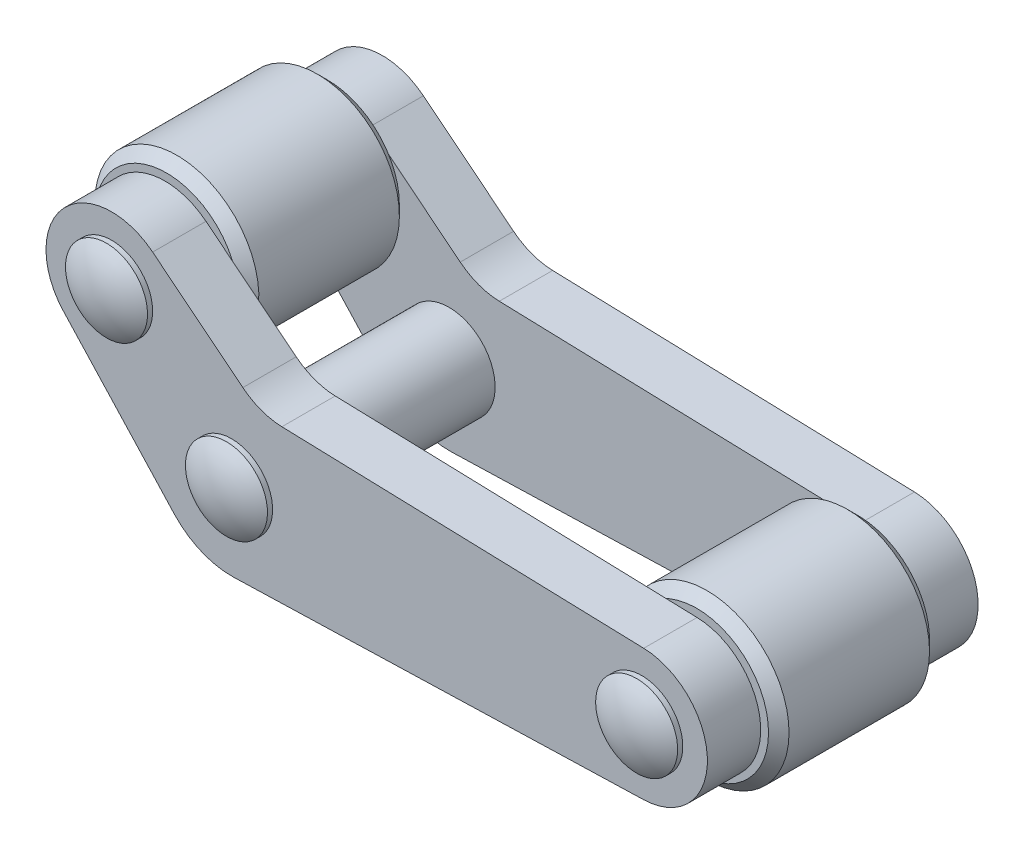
ISO-10303-21;
HEADER;
FILE_DESCRIPTION(('STEP AP214'),'2;1');
FILE_NAME('part.step','',(''),(''),'','','');
FILE_SCHEMA(('AUTOMOTIVE_DESIGN { 1 0 10303 214 1 1 1 1 }'));
ENDSEC;
DATA;
#1=APPLICATION_CONTEXT('core data for automotive mechanical design processes');
#2=APPLICATION_PROTOCOL_DEFINITION('international standard','automotive_design',2000,#1);
#3=PRODUCT_CONTEXT('',#1,'mechanical');
#4=PRODUCT('Part','Part','',(#3));
#5=PRODUCT_RELATED_PRODUCT_CATEGORY('part','',(#4));
#6=PRODUCT_DEFINITION_FORMATION('','',#4);
#7=PRODUCT_DEFINITION_CONTEXT('part definition',#1,'design');
#8=PRODUCT_DEFINITION('design','',#6,#7);
#9=PRODUCT_DEFINITION_SHAPE('','',#8);
#10=(LENGTH_UNIT() NAMED_UNIT(*) SI_UNIT(.MILLI.,.METRE.));
#11=(NAMED_UNIT(*) PLANE_ANGLE_UNIT() SI_UNIT($,.RADIAN.));
#12=(NAMED_UNIT(*) SI_UNIT($,.STERADIAN.) SOLID_ANGLE_UNIT());
#13=UNCERTAINTY_MEASURE_WITH_UNIT(LENGTH_MEASURE(1.E-05),#10,'distance_accuracy_value','');
#14=(GEOMETRIC_REPRESENTATION_CONTEXT(3) GLOBAL_UNCERTAINTY_ASSIGNED_CONTEXT((#13)) GLOBAL_UNIT_ASSIGNED_CONTEXT((#10,
#11,#12)) REPRESENTATION_CONTEXT('',''));
#15=CARTESIAN_POINT('',(0.,0.,0.));
#16=DIRECTION('',(0.,0.,1.));
#17=DIRECTION('',(1.,0.,0.));
#18=AXIS2_PLACEMENT_3D('',#15,#16,#17);
#19=CARTESIAN_POINT('',(-17.3489132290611,9.45804122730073,-6.59999999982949));
#20=DIRECTION('',(0.,0.,-1.));
#21=DIRECTION('',(-1.,0.,0.));
#22=AXIS2_PLACEMENT_3D('',#19,#20,#21);
#23=CONICAL_SURFACE('',#22,1.8999999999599,0.785398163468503);
#24=CARTESIAN_POINT('',(-17.3489132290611,9.45804122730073,-6.2));
#25=DIRECTION('',(0.,0.,-1.));
#26=DIRECTION('',(-1.,0.,0.));
#27=AXIS2_PLACEMENT_3D('',#24,#25,#26);
#28=CIRCLE('',#27,1.5);
#29=CARTESIAN_POINT('',(-18.8489132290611,9.45804122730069,-6.2));
#30=VERTEX_POINT('',#29);
#31=EDGE_CURVE('P0_E135',#30,#30,#28,.F.);
#32=ORIENTED_EDGE('',*,*,#31,.T.);
#33=EDGE_LOOP('',(#32));
#34=FACE_BOUND('',#33,.T.);
#35=CARTESIAN_POINT('',(-17.3489132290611,9.45804122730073,-6.59999999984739));
#36=DIRECTION('',(0.,0.,-1.));
#37=DIRECTION('',(-1.,0.,0.));
#38=AXIS2_PLACEMENT_3D('',#35,#36,#37);
#39=CIRCLE('',#38,1.89999999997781);
#40=CARTESIAN_POINT('',(-19.2489132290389,9.45804122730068,-6.59999999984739));
#41=VERTEX_POINT('',#40);
#42=EDGE_CURVE('P0_E19',#41,#41,#39,.F.);
#43=ORIENTED_EDGE('',*,*,#42,.F.);
#44=EDGE_LOOP('',(#43));
#45=FACE_BOUND('',#44,.T.);
#46=ADVANCED_FACE('P0_F16',(#34,#45),#23,.F.);
#47=CARTESIAN_POINT('',(-11.5,4.,-6.59999999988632));
#48=DIRECTION('',(0.,0.,-1.));
#49=DIRECTION('',(-1.,0.,0.));
#50=AXIS2_PLACEMENT_3D('',#47,#48,#49);
#51=CONICAL_SURFACE('',#50,1.89999999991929,0.785398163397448);
#52=CARTESIAN_POINT('',(-11.5,4.,-6.2));
#53=DIRECTION('',(0.,0.,-1.));
#54=DIRECTION('',(-1.,0.,0.));
#55=AXIS2_PLACEMENT_3D('',#52,#53,#54);
#56=CIRCLE('',#55,1.5);
#57=CARTESIAN_POINT('',(-13.,3.99999999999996,-6.2));
#58=VERTEX_POINT('',#57);
#59=EDGE_CURVE('P0_E132',#58,#58,#56,.F.);
#60=ORIENTED_EDGE('',*,*,#59,.T.);
#61=EDGE_LOOP('',(#60));
#62=FACE_BOUND('',#61,.T.);
#63=CARTESIAN_POINT('',(-11.5,4.,-6.60000000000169));
#64=DIRECTION('',(0.,0.,-1.));
#65=DIRECTION('',(-1.,0.,0.));
#66=AXIS2_PLACEMENT_3D('',#63,#64,#65);
#67=CIRCLE('',#66,1.90000000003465);
#68=CARTESIAN_POINT('',(-13.4000000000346,3.99999999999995,-6.60000000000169));
#69=VERTEX_POINT('',#68);
#70=EDGE_CURVE('P0_E163',#69,#69,#67,.F.);
#71=ORIENTED_EDGE('',*,*,#70,.F.);
#72=EDGE_LOOP('',(#71));
#73=FACE_BOUND('',#72,.T.);
#74=ADVANCED_FACE('P0_F172',(#62,#73),#51,.F.);
#75=CARTESIAN_POINT('',(8.5,4.,-6.59999999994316));
#76=DIRECTION('',(0.,0.,-1.));
#77=DIRECTION('',(-1.,0.,0.));
#78=AXIS2_PLACEMENT_3D('',#75,#76,#77);
#79=CONICAL_SURFACE('',#78,1.89999999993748,0.785398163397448);
#80=CARTESIAN_POINT('',(8.5,4.,-6.2));
#81=DIRECTION('',(0.,0.,-1.));
#82=DIRECTION('',(-1.,0.,0.));
#83=AXIS2_PLACEMENT_3D('',#80,#81,#82);
#84=CIRCLE('',#83,1.5);
#85=CARTESIAN_POINT('',(7.,3.99999999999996,-6.2));
#86=VERTEX_POINT('',#85);
#87=EDGE_CURVE('P0_E129',#86,#86,#84,.F.);
#88=ORIENTED_EDGE('',*,*,#87,.T.);
#89=EDGE_LOOP('',(#88));
#90=FACE_BOUND('',#89,.T.);
#91=CARTESIAN_POINT('',(8.5,4.,-6.60000000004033));
#92=DIRECTION('',(0.,0.,-1.));
#93=DIRECTION('',(-1.,0.,0.));
#94=AXIS2_PLACEMENT_3D('',#91,#92,#93);
#95=CIRCLE('',#94,1.90000000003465);
#96=CARTESIAN_POINT('',(6.59999999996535,3.99999999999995,-6.60000000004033));
#97=VERTEX_POINT('',#96);
#98=EDGE_CURVE('P0_E128',#97,#97,#95,.F.);
#99=ORIENTED_EDGE('',*,*,#98,.F.);
#100=EDGE_LOOP('',(#99));
#101=FACE_BOUND('',#100,.T.);
#102=ADVANCED_FACE('P0_F178',(#90,#101),#79,.F.);
#103=CARTESIAN_POINT('',(-17.3489132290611,9.45804122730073,-3.6));
#104=DIRECTION('',(0.,0.,-1.));
#105=DIRECTION('',(-1.,0.,0.));
#106=AXIS2_PLACEMENT_3D('',#103,#104,#105);
#107=CYLINDRICAL_SURFACE('',#106,1.5);
#108=CARTESIAN_POINT('',(-17.3489132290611,9.45804122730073,-4.40000000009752));
#109=DIRECTION('',(0.,0.,1.));
#110=DIRECTION('',(1.,0.,0.));
#111=AXIS2_PLACEMENT_3D('',#108,#109,#110);
#112=CIRCLE('',#111,1.50000000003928);
#113=CARTESIAN_POINT('',(-15.8489132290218,9.45804122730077,-4.40000000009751));
#114=VERTEX_POINT('',#113);
#115=EDGE_CURVE('P0_E125',#114,#114,#112,.T.);
#116=ORIENTED_EDGE('',*,*,#115,.T.);
#117=EDGE_LOOP('',(#116));
#118=FACE_BOUND('',#117,.T.);
#119=ORIENTED_EDGE('',*,*,#31,.F.);
#120=EDGE_LOOP('',(#119));
#121=FACE_BOUND('',#120,.T.);
#122=ADVANCED_FACE('P0_F236',(#118,#121),#107,.F.);
#123=CARTESIAN_POINT('',(-11.5,4.,-3.6));
#124=DIRECTION('',(0.,0.,-1.));
#125=DIRECTION('',(-1.,0.,0.));
#126=AXIS2_PLACEMENT_3D('',#123,#124,#125);
#127=CYLINDRICAL_SURFACE('',#126,1.5);
#128=CARTESIAN_POINT('',(-11.5,4.,-4.39999999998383));
#129=DIRECTION('',(0.,0.,1.));
#130=DIRECTION('',(1.,0.,0.));
#131=AXIS2_PLACEMENT_3D('',#128,#129,#130);
#132=CIRCLE('',#131,1.50000000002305);
#133=CARTESIAN_POINT('',(-9.99999999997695,4.00000000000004,-4.39999999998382));
#134=VERTEX_POINT('',#133);
#135=EDGE_CURVE('P0_E122',#134,#134,#132,.T.);
#136=ORIENTED_EDGE('',*,*,#135,.T.);
#137=EDGE_LOOP('',(#136));
#138=FACE_BOUND('',#137,.T.);
#139=ORIENTED_EDGE('',*,*,#59,.F.);
#140=EDGE_LOOP('',(#139));
#141=FACE_BOUND('',#140,.T.);
#142=ADVANCED_FACE('P0_F232',(#138,#141),#127,.F.);
#143=CARTESIAN_POINT('',(8.5,4.,-3.6));
#144=DIRECTION('',(0.,0.,-1.));
#145=DIRECTION('',(-1.,0.,0.));
#146=AXIS2_PLACEMENT_3D('',#143,#144,#145);
#147=CYLINDRICAL_SURFACE('',#146,1.5);
#148=CARTESIAN_POINT('',(8.5,4.,-4.40000000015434));
#149=DIRECTION('',(0.,0.,1.));
#150=DIRECTION('',(1.,0.,0.));
#151=AXIS2_PLACEMENT_3D('',#148,#149,#150);
#152=CIRCLE('',#151,1.49999999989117);
#153=CARTESIAN_POINT('',(9.99999999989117,4.00000000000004,-4.40000000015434));
#154=VERTEX_POINT('',#153);
#155=EDGE_CURVE('P0_E102',#154,#154,#152,.T.);
#156=ORIENTED_EDGE('',*,*,#155,.T.);
#157=EDGE_LOOP('',(#156));
#158=FACE_BOUND('',#157,.T.);
#159=ORIENTED_EDGE('',*,*,#87,.F.);
#160=EDGE_LOOP('',(#159));
#161=FACE_BOUND('',#160,.T.);
#162=ADVANCED_FACE('P0_F229',(#158,#161),#147,.F.);
#163=CARTESIAN_POINT('',(8.5,4.,-6.6));
#164=DIRECTION('',(0.,0.,-1.));
#165=DIRECTION('',(-1.,0.,0.));
#166=AXIS2_PLACEMENT_3D('',#163,#164,#165);
#167=PLANE('',#166);
#168=DIRECTION('',(-0.677885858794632,0.735167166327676,0.));
#169=VECTOR('',#168,1.);
#170=CARTESIAN_POINT('',(-19.7014481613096,7.28880647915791,-6.6));
#171=LINE('',#170,#169);
#172=CARTESIAN_POINT('',(-19.7014481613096,7.28880647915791,-6.6));
#173=VERTEX_POINT('',#172);
#174=CARTESIAN_POINT('',(-14.2936352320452,1.42403373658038,-6.6));
#175=VERTEX_POINT('',#174);
#176=EDGE_CURVE('P0_E116',#173,#175,#171,.F.);
#177=ORIENTED_EDGE('',*,*,#176,.F.);
#178=CARTESIAN_POINT('',(-17.3489132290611,9.45804122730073,-6.6));
#179=DIRECTION('',(0.,0.,-1.));
#180=DIRECTION('',(-1.,0.,0.));
#181=AXIS2_PLACEMENT_3D('',#178,#179,#180);
#182=CIRCLE('',#181,3.2);
#183=CARTESIAN_POINT('',(-15.3481900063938,11.9554612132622,-6.6));
#184=VERTEX_POINT('',#183);
#185=EDGE_CURVE('P0_E115',#184,#173,#182,.F.);
#186=ORIENTED_EDGE('',*,*,#185,.F.);
#187=DIRECTION('',(0.780443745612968,-0.625226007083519,0.));
#188=VECTOR('',#187,1.);
#189=CARTESIAN_POINT('',(-15.3481900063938,11.9554612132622,-6.6));
#190=LINE('',#189,#188);
#191=CARTESIAN_POINT('',(-10.9507232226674,8.43258001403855,-6.6));
#192=VERTEX_POINT('',#191);
#193=EDGE_CURVE('P0_E112',#192,#184,#190,.F.);
#194=ORIENTED_EDGE('',*,*,#193,.F.);
#195=CARTESIAN_POINT('',(-8.95000000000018,10.93,-6.6));
#196=DIRECTION('',(0.,0.,-1.));
#197=DIRECTION('',(-1.,0.,0.));
#198=AXIS2_PLACEMENT_3D('',#195,#196,#197);
#199=CIRCLE('',#198,3.2);
#200=CARTESIAN_POINT('',(-9.04661265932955,7.73145877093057,-6.6));
#201=VERTEX_POINT('',#200);
#202=EDGE_CURVE('P0_E98',#192,#201,#199,.F.);
#203=ORIENTED_EDGE('',*,*,#202,.T.);
#204=DIRECTION('',(0.999544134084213,-0.0301914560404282,0.));
#205=VECTOR('',#204,1.);
#206=CARTESIAN_POINT('',(8.59600000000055,7.1985596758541,-6.6));
#207=LINE('',#206,#205);
#208=CARTESIAN_POINT('',(8.59600000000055,7.1985596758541,-6.6));
#209=VERTEX_POINT('',#208);
#210=EDGE_CURVE('P0_E92',#209,#201,#207,.F.);
#211=ORIENTED_EDGE('',*,*,#210,.F.);
#212=CARTESIAN_POINT('',(8.5,4.,-6.6));
#213=DIRECTION('',(0.,0.,-1.));
#214=DIRECTION('',(-1.,0.,0.));
#215=AXIS2_PLACEMENT_3D('',#212,#213,#214);
#216=CIRCLE('',#215,3.2);
#217=CARTESIAN_POINT('',(8.596,0.801440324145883,-6.6));
#218=VERTEX_POINT('',#217);
#219=EDGE_CURVE('P0_E83',#218,#209,#216,.F.);
#220=ORIENTED_EDGE('',*,*,#219,.F.);
#221=DIRECTION('',(-0.999549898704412,-0.0300000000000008,0.));
#222=VECTOR('',#221,1.);
#223=CARTESIAN_POINT('',(8.596,0.801440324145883,-6.6));
#224=LINE('',#223,#222);
#225=CARTESIAN_POINT('',(-11.386,0.201710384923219,-6.6));
#226=VERTEX_POINT('',#225);
#227=EDGE_CURVE('P0_E78',#226,#218,#224,.F.);
#228=ORIENTED_EDGE('',*,*,#227,.F.);
#229=CARTESIAN_POINT('',(-11.5,4.,-6.6));
#230=DIRECTION('',(0.,0.,-1.));
#231=DIRECTION('',(-1.,0.,0.));
#232=AXIS2_PLACEMENT_3D('',#229,#230,#231);
#233=CIRCLE('',#232,3.8);
#234=EDGE_CURVE('P0_E160',#175,#226,#233,.F.);
#235=ORIENTED_EDGE('',*,*,#234,.F.);
#236=EDGE_LOOP('',(#177,#186,#194,#203,#211,#220,#228,#235));
#237=FACE_BOUND('',#236,.T.);
#238=ORIENTED_EDGE('',*,*,#98,.T.);
#239=EDGE_LOOP('',(#238));
#240=FACE_BOUND('',#239,.T.);
#241=ORIENTED_EDGE('',*,*,#70,.T.);
#242=EDGE_LOOP('',(#241));
#243=FACE_BOUND('',#242,.T.);
#244=ORIENTED_EDGE('',*,*,#42,.T.);
#245=EDGE_LOOP('',(#244));
#246=FACE_BOUND('',#245,.T.);
#247=ADVANCED_FACE('P0_F96',(#237,#240,#243,#246),#167,.T.);
#248=CARTESIAN_POINT('',(-17.3489132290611,9.45804122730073,-4.00000000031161));
#249=DIRECTION('',(0.,0.,1.));
#250=DIRECTION('',(1.,0.,0.));
#251=AXIS2_PLACEMENT_3D('',#248,#249,#250);
#252=CONICAL_SURFACE('',#251,1.89999999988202,0.785398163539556);
#253=ORIENTED_EDGE('',*,*,#115,.F.);
#254=EDGE_LOOP('',(#253));
#255=FACE_BOUND('',#254,.T.);
#256=CARTESIAN_POINT('',(-17.3489132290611,9.45804122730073,-4.00000000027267));
#257=DIRECTION('',(0.,0.,1.));
#258=DIRECTION('',(1.,0.,0.));
#259=AXIS2_PLACEMENT_3D('',#256,#257,#258);
#260=CIRCLE('',#259,1.89999999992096);
#261=CARTESIAN_POINT('',(-15.4489132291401,9.45804122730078,-4.00000000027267));
#262=VERTEX_POINT('',#261);
#263=EDGE_CURVE('P0_E153',#262,#262,#260,.T.);
#264=ORIENTED_EDGE('',*,*,#263,.T.);
#265=EDGE_LOOP('',(#264));
#266=FACE_BOUND('',#265,.T.);
#267=ADVANCED_FACE('P0_F222',(#255,#266),#252,.F.);
#268=CARTESIAN_POINT('',(-11.5,4.,-4.00000000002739));
#269=DIRECTION('',(0.,0.,1.));
#270=DIRECTION('',(1.,0.,0.));
#271=AXIS2_PLACEMENT_3D('',#268,#269,#270);
#272=CONICAL_SURFACE('',#271,1.90000000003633,0.785398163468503);
#273=ORIENTED_EDGE('',*,*,#135,.F.);
#274=EDGE_LOOP('',(#273));
#275=FACE_BOUND('',#274,.T.);
#276=CARTESIAN_POINT('',(-11.5,4.,-4.00000000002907));
#277=DIRECTION('',(0.,0.,1.));
#278=DIRECTION('',(1.,0.,0.));
#279=AXIS2_PLACEMENT_3D('',#276,#277,#278);
#280=CIRCLE('',#279,1.90000000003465);
#281=CARTESIAN_POINT('',(-9.59999999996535,4.00000000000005,-4.00000000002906));
#282=VERTEX_POINT('',#281);
#283=EDGE_CURVE('P0_E150',#282,#282,#280,.T.);
#284=ORIENTED_EDGE('',*,*,#283,.T.);
#285=EDGE_LOOP('',(#284));
#286=FACE_BOUND('',#285,.T.);
#287=ADVANCED_FACE('P0_F218',(#275,#286),#272,.F.);
#288=CARTESIAN_POINT('',(8.5,4.,-4.00000000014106));
#289=DIRECTION('',(0.,0.,1.));
#290=DIRECTION('',(1.,0.,0.));
#291=AXIS2_PLACEMENT_3D('',#288,#289,#290);
#292=CONICAL_SURFACE('',#291,1.8999999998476,0.785398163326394);
#293=ORIENTED_EDGE('',*,*,#155,.F.);
#294=EDGE_LOOP('',(#293));
#295=FACE_BOUND('',#294,.T.);
#296=CARTESIAN_POINT('',(8.5,4.,-4.00000000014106));
#297=DIRECTION('',(0.,0.,1.));
#298=DIRECTION('',(1.,0.,0.));
#299=AXIS2_PLACEMENT_3D('',#296,#297,#298);
#300=CIRCLE('',#299,1.8999999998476);
#301=CARTESIAN_POINT('',(10.3999999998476,4.00000000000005,-4.00000000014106));
#302=VERTEX_POINT('',#301);
#303=EDGE_CURVE('P0_E147',#302,#302,#300,.T.);
#304=ORIENTED_EDGE('',*,*,#303,.T.);
#305=EDGE_LOOP('',(#304));
#306=FACE_BOUND('',#305,.T.);
#307=ADVANCED_FACE('P0_F215',(#295,#306),#292,.F.);
#308=CARTESIAN_POINT('',(8.59600000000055,7.1985596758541,-4.));
#309=DIRECTION('',(0.0301914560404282,0.999544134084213,0.));
#310=DIRECTION('',(0.999544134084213,-0.0301914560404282,0.));
#311=AXIS2_PLACEMENT_3D('',#308,#309,#310);
#312=PLANE('',#311);
#313=DIRECTION('',(0.999544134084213,-0.0301914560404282,0.));
#314=VECTOR('',#313,1.);
#315=CARTESIAN_POINT('',(-9.04661265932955,7.73145877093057,-4.));
#316=LINE('',#315,#314);
#317=CARTESIAN_POINT('',(-9.04661265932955,7.73145877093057,-4.));
#318=VERTEX_POINT('',#317);
#319=CARTESIAN_POINT('',(8.59600000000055,7.1985596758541,-4.));
#320=VERTEX_POINT('',#319);
#321=EDGE_CURVE('P0_E106',#318,#320,#316,.T.);
#322=ORIENTED_EDGE('',*,*,#321,.T.);
#323=DIRECTION('',(0.,0.,-1.));
#324=VECTOR('',#323,1.);
#325=CARTESIAN_POINT('',(8.59600000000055,7.1985596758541,-4.));
#326=LINE('',#325,#324);
#327=EDGE_CURVE('P0_E88',#209,#320,#326,.F.);
#328=ORIENTED_EDGE('',*,*,#327,.F.);
#329=ORIENTED_EDGE('',*,*,#210,.T.);
#330=DIRECTION('',(0.,0.,-1.));
#331=VECTOR('',#330,1.);
#332=CARTESIAN_POINT('',(-9.04661265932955,7.73145877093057,-4.));
#333=LINE('',#332,#331);
#334=EDGE_CURVE('P0_E156',#201,#318,#333,.F.);
#335=ORIENTED_EDGE('',*,*,#334,.T.);
#336=EDGE_LOOP('',(#322,#328,#329,#335));
#337=FACE_BOUND('',#336,.T.);
#338=ADVANCED_FACE('P0_F105',(#337),#312,.T.);
#339=CARTESIAN_POINT('',(8.5,4.,-4.));
#340=DIRECTION('',(0.,0.,-1.));
#341=DIRECTION('',(-1.,0.,0.));
#342=AXIS2_PLACEMENT_3D('',#339,#340,#341);
#343=CYLINDRICAL_SURFACE('',#342,3.2);
#344=CARTESIAN_POINT('',(8.5,4.,-4.));
#345=DIRECTION('',(0.,0.,-1.));
#346=DIRECTION('',(-1.,0.,0.));
#347=AXIS2_PLACEMENT_3D('',#344,#345,#346);
#348=CIRCLE('',#347,3.2);
#349=CARTESIAN_POINT('',(8.596,0.801440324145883,-4.));
#350=VERTEX_POINT('',#349);
#351=EDGE_CURVE('P0_E145',#320,#350,#348,.T.);
#352=ORIENTED_EDGE('',*,*,#351,.T.);
#353=DIRECTION('',(0.,0.,-1.));
#354=VECTOR('',#353,1.);
#355=CARTESIAN_POINT('',(8.596,0.801440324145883,-4.));
#356=LINE('',#355,#354);
#357=EDGE_CURVE('P0_E90',#218,#350,#356,.F.);
#358=ORIENTED_EDGE('',*,*,#357,.F.);
#359=ORIENTED_EDGE('',*,*,#219,.T.);
#360=ORIENTED_EDGE('',*,*,#327,.T.);
#361=EDGE_LOOP('',(#352,#358,#359,#360));
#362=FACE_BOUND('',#361,.T.);
#363=ADVANCED_FACE('P0_F86',(#362),#343,.T.);
#364=CARTESIAN_POINT('',(8.596,0.801440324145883,-4.));
#365=DIRECTION('',(0.0300000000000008,-0.999549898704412,0.));
#366=DIRECTION('',(-0.999549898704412,-0.0300000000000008,0.));
#367=AXIS2_PLACEMENT_3D('',#364,#365,#366);
#368=PLANE('',#367);
#369=DIRECTION('',(-0.999549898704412,-0.0300000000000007,0.));
#370=VECTOR('',#369,1.);
#371=CARTESIAN_POINT('',(8.596,0.801440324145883,-4.));
#372=LINE('',#371,#370);
#373=CARTESIAN_POINT('',(-11.386,0.201710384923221,-4.));
#374=VERTEX_POINT('',#373);
#375=EDGE_CURVE('P0_E144',#350,#374,#372,.T.);
#376=ORIENTED_EDGE('',*,*,#375,.T.);
#377=DIRECTION('',(0.,0.,-1.));
#378=VECTOR('',#377,1.);
#379=CARTESIAN_POINT('',(-11.386,0.20171038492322,-4.));
#380=LINE('',#379,#378);
#381=EDGE_CURVE('P0_E118',#226,#374,#380,.F.);
#382=ORIENTED_EDGE('',*,*,#381,.F.);
#383=ORIENTED_EDGE('',*,*,#227,.T.);
#384=ORIENTED_EDGE('',*,*,#357,.T.);
#385=EDGE_LOOP('',(#376,#382,#383,#384));
#386=FACE_BOUND('',#385,.T.);
#387=ADVANCED_FACE('P0_F207',(#386),#368,.T.);
#388=CARTESIAN_POINT('',(-11.5,4.,-4.));
#389=DIRECTION('',(0.,0.,-1.));
#390=DIRECTION('',(-1.,0.,0.));
#391=AXIS2_PLACEMENT_3D('',#388,#389,#390);
#392=CYLINDRICAL_SURFACE('',#391,3.8);
#393=CARTESIAN_POINT('',(-11.5,4.,-4.));
#394=DIRECTION('',(0.,0.,-1.));
#395=DIRECTION('',(-1.,0.,0.));
#396=AXIS2_PLACEMENT_3D('',#393,#394,#395);
#397=CIRCLE('',#396,3.8);
#398=CARTESIAN_POINT('',(-14.2936352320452,1.42403373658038,-4.));
#399=VERTEX_POINT('',#398);
#400=EDGE_CURVE('P0_E141',#374,#399,#397,.T.);
#401=ORIENTED_EDGE('',*,*,#400,.T.);
#402=DIRECTION('',(0.,0.,-1.));
#403=VECTOR('',#402,1.);
#404=CARTESIAN_POINT('',(-14.2936352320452,1.42403373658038,-4.));
#405=LINE('',#404,#403);
#406=EDGE_CURVE('P0_E117',#175,#399,#405,.F.);
#407=ORIENTED_EDGE('',*,*,#406,.F.);
#408=ORIENTED_EDGE('',*,*,#234,.T.);
#409=ORIENTED_EDGE('',*,*,#381,.T.);
#410=EDGE_LOOP('',(#401,#407,#408,#409));
#411=FACE_BOUND('',#410,.T.);
#412=ADVANCED_FACE('P0_F203',(#411),#392,.T.);
#413=CARTESIAN_POINT('',(-19.7014481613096,7.28880647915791,-4.));
#414=DIRECTION('',(-0.735167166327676,-0.677885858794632,0.));
#415=DIRECTION('',(-0.677885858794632,0.735167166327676,0.));
#416=AXIS2_PLACEMENT_3D('',#413,#414,#415);
#417=PLANE('',#416);
#418=DIRECTION('',(-0.677885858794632,0.735167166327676,0.));
#419=VECTOR('',#418,1.);
#420=CARTESIAN_POINT('',(-14.2936352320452,1.42403373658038,-4.));
#421=LINE('',#420,#419);
#422=CARTESIAN_POINT('',(-19.7014481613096,7.28880647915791,-4.));
#423=VERTEX_POINT('',#422);
#424=EDGE_CURVE('P0_E140',#399,#423,#421,.T.);
#425=ORIENTED_EDGE('',*,*,#424,.T.);
#426=DIRECTION('',(0.,0.,-1.));
#427=VECTOR('',#426,1.);
#428=CARTESIAN_POINT('',(-19.7014481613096,7.28880647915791,-4.));
#429=LINE('',#428,#427);
#430=EDGE_CURVE('P0_E159',#173,#423,#429,.F.);
#431=ORIENTED_EDGE('',*,*,#430,.F.);
#432=ORIENTED_EDGE('',*,*,#176,.T.);
#433=ORIENTED_EDGE('',*,*,#406,.T.);
#434=EDGE_LOOP('',(#425,#431,#432,#433));
#435=FACE_BOUND('',#434,.T.);
#436=ADVANCED_FACE('P0_F199',(#435),#417,.T.);
#437=CARTESIAN_POINT('',(-17.3489132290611,9.45804122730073,-4.));
#438=DIRECTION('',(0.,0.,-1.));
#439=DIRECTION('',(-1.,0.,0.));
#440=AXIS2_PLACEMENT_3D('',#437,#438,#439);
#441=CYLINDRICAL_SURFACE('',#440,3.2);
#442=DIRECTION('',(0.,0.,-1.));
#443=VECTOR('',#442,1.);
#444=CARTESIAN_POINT('',(-15.3481900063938,11.9554612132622,-4.));
#445=LINE('',#444,#443);
#446=CARTESIAN_POINT('',(-15.3481900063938,11.9554612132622,-4.));
#447=VERTEX_POINT('',#446);
#448=EDGE_CURVE('P0_E114',#184,#447,#445,.F.);
#449=ORIENTED_EDGE('',*,*,#448,.F.);
#450=ORIENTED_EDGE('',*,*,#185,.T.);
#451=ORIENTED_EDGE('',*,*,#430,.T.);
#452=CARTESIAN_POINT('',(-17.3489132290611,9.45804122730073,-4.));
#453=DIRECTION('',(0.,0.,-1.));
#454=DIRECTION('',(-1.,0.,0.));
#455=AXIS2_PLACEMENT_3D('',#452,#453,#454);
#456=CIRCLE('',#455,3.2);
#457=EDGE_CURVE('P0_E138',#423,#447,#456,.T.);
#458=ORIENTED_EDGE('',*,*,#457,.T.);
#459=EDGE_LOOP('',(#449,#450,#451,#458));
#460=FACE_BOUND('',#459,.T.);
#461=ADVANCED_FACE('P0_F195',(#460),#441,.T.);
#462=CARTESIAN_POINT('',(-15.3481900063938,11.9554612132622,-4.));
#463=DIRECTION('',(0.625226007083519,0.780443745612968,0.));
#464=DIRECTION('',(0.780443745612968,-0.625226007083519,0.));
#465=AXIS2_PLACEMENT_3D('',#462,#463,#464);
#466=PLANE('',#465);
#467=DIRECTION('',(0.780443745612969,-0.625226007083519,0.));
#468=VECTOR('',#467,1.);
#469=CARTESIAN_POINT('',(-15.3481900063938,11.9554612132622,-4.));
#470=LINE('',#469,#468);
#471=CARTESIAN_POINT('',(-10.9507232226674,8.43258001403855,-4.));
#472=VERTEX_POINT('',#471);
#473=EDGE_CURVE('P0_E25',#447,#472,#470,.T.);
#474=ORIENTED_EDGE('',*,*,#473,.T.);
#475=DIRECTION('',(0.,0.,-1.));
#476=VECTOR('',#475,1.);
#477=CARTESIAN_POINT('',(-10.9507232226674,8.43258001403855,-4.));
#478=LINE('',#477,#476);
#479=EDGE_CURVE('P0_E33',#472,#192,#478,.T.);
#480=ORIENTED_EDGE('',*,*,#479,.T.);
#481=ORIENTED_EDGE('',*,*,#193,.T.);
#482=ORIENTED_EDGE('',*,*,#448,.T.);
#483=EDGE_LOOP('',(#474,#480,#481,#482));
#484=FACE_BOUND('',#483,.T.);
#485=ADVANCED_FACE('P0_F188',(#484),#466,.T.);
#486=CARTESIAN_POINT('',(-8.95000000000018,10.93,-4.));
#487=DIRECTION('',(0.,0.,-1.));
#488=DIRECTION('',(-1.,0.,0.));
#489=AXIS2_PLACEMENT_3D('',#486,#487,#488);
#490=CYLINDRICAL_SURFACE('',#489,3.2);
#491=ORIENTED_EDGE('',*,*,#334,.F.);
#492=ORIENTED_EDGE('',*,*,#202,.F.);
#493=ORIENTED_EDGE('',*,*,#479,.F.);
#494=CARTESIAN_POINT('',(-8.95000000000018,10.93,-4.));
#495=DIRECTION('',(0.,0.,-1.));
#496=DIRECTION('',(-1.,0.,0.));
#497=AXIS2_PLACEMENT_3D('',#494,#495,#496);
#498=CIRCLE('',#497,3.2);
#499=EDGE_CURVE('P0_E11',#472,#318,#498,.F.);
#500=ORIENTED_EDGE('',*,*,#499,.T.);
#501=EDGE_LOOP('',(#491,#492,#493,#500));
#502=FACE_BOUND('',#501,.T.);
#503=ADVANCED_FACE('P0_F182',(#502),#490,.F.);
#504=CARTESIAN_POINT('',(8.5,4.,-4.));
#505=DIRECTION('',(0.,0.,-1.));
#506=DIRECTION('',(-1.,0.,0.));
#507=AXIS2_PLACEMENT_3D('',#504,#505,#506);
#508=PLANE('',#507);
#509=ORIENTED_EDGE('',*,*,#473,.F.);
#510=ORIENTED_EDGE('',*,*,#457,.F.);
#511=ORIENTED_EDGE('',*,*,#424,.F.);
#512=ORIENTED_EDGE('',*,*,#400,.F.);
#513=ORIENTED_EDGE('',*,*,#375,.F.);
#514=ORIENTED_EDGE('',*,*,#351,.F.);
#515=ORIENTED_EDGE('',*,*,#321,.F.);
#516=ORIENTED_EDGE('',*,*,#499,.F.);
#517=EDGE_LOOP('',(#509,#510,#511,#512,#513,#514,#515,#516));
#518=FACE_BOUND('',#517,.T.);
#519=ORIENTED_EDGE('',*,*,#303,.F.);
#520=EDGE_LOOP('',(#519));
#521=FACE_BOUND('',#520,.T.);
#522=ORIENTED_EDGE('',*,*,#283,.F.);
#523=EDGE_LOOP('',(#522));
#524=FACE_BOUND('',#523,.T.);
#525=ORIENTED_EDGE('',*,*,#263,.F.);
#526=EDGE_LOOP('',(#525));
#527=FACE_BOUND('',#526,.T.);
#528=ADVANCED_FACE('P0_F180',(#518,#521,#524,#527),#508,.F.);
#529=CLOSED_SHELL('',(#46,#74,#102,#122,#142,#162,#247,#267,#287,#307,#338,#363,#387,#412,#436,
#461,#485,#503,#528));
#530=MANIFOLD_SOLID_BREP('P0_B1',#529);
#531=CARTESIAN_POINT('',(-17.3489132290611,9.45804122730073,-3.93));
#532=DIRECTION('',(0.,0.,-1.));
#533=DIRECTION('',(-0.993895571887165,-0.110324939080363,0.));
#534=AXIS2_PLACEMENT_3D('',#531,#532,#533);
#535=CYLINDRICAL_SURFACE('',#534,2.25);
#536=CARTESIAN_POINT('',(-17.3489132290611,9.45804122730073,3.72000000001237));
#537=DIRECTION('',(0.,0.,1.));
#538=DIRECTION('',(0.993895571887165,0.110324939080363,0.));
#539=AXIS2_PLACEMENT_3D('',#536,#537,#538);
#540=CIRCLE('',#539,2.25000000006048);
#541=CARTESIAN_POINT('',(-15.1126481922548,9.70627234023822,3.72000000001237));
#542=VERTEX_POINT('',#541);
#543=EDGE_CURVE('P1_E32',#542,#542,#540,.T.);
#544=ORIENTED_EDGE('',*,*,#543,.T.);
#545=EDGE_LOOP('',(#544));
#546=FACE_BOUND('',#545,.T.);
#547=CARTESIAN_POINT('',(-17.3489132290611,9.45804122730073,-3.73000000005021));
#548=DIRECTION('',(0.,0.,-1.));
#549=DIRECTION('',(-0.993895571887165,-0.110324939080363,0.));
#550=AXIS2_PLACEMENT_3D('',#547,#548,#549);
#551=CIRCLE('',#550,2.2499999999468);
#552=CARTESIAN_POINT('',(-19.5851782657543,9.20981011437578,-3.73000000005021));
#553=VERTEX_POINT('',#552);
#554=EDGE_CURVE('P1_E29',#553,#553,#551,.T.);
#555=ORIENTED_EDGE('',*,*,#554,.T.);
#556=EDGE_LOOP('',(#555));
#557=FACE_BOUND('',#556,.T.);
#558=ADVANCED_FACE('P1_F14',(#546,#557),#535,.F.);
#559=CARTESIAN_POINT('',(-17.3489132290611,9.45804122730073,3.91999999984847));
#560=DIRECTION('',(0.,0.,1.));
#561=DIRECTION('',(0.993895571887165,0.110324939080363,0.));
#562=AXIS2_PLACEMENT_3D('',#559,#560,#561);
#563=CONICAL_SURFACE('',#562,2.44999999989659,0.785398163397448);
#564=ORIENTED_EDGE('',*,*,#543,.F.);
#565=EDGE_LOOP('',(#564));
#566=FACE_BOUND('',#565,.T.);
#567=CARTESIAN_POINT('',(-17.3489132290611,9.45804122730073,3.91999999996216));
#568=DIRECTION('',(0.,0.,1.));
#569=DIRECTION('',(0.993895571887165,0.110324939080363,0.));
#570=AXIS2_PLACEMENT_3D('',#567,#568,#569);
#571=CIRCLE('',#570,2.45000000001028);
#572=CARTESIAN_POINT('',(-14.9138690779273,9.72833732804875,3.91999999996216));
#573=VERTEX_POINT('',#572);
#574=EDGE_CURVE('P1_E17',#573,#573,#571,.T.);
#575=ORIENTED_EDGE('',*,*,#574,.T.);
#576=EDGE_LOOP('',(#575));
#577=FACE_BOUND('',#576,.T.);
#578=ADVANCED_FACE('P1_F46',(#566,#577),#563,.F.);
#579=CARTESIAN_POINT('',(-17.3489132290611,9.45804122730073,-3.93000000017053));
#580=DIRECTION('',(0.,0.,-1.));
#581=DIRECTION('',(-0.993895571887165,-0.110324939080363,0.));
#582=AXIS2_PLACEMENT_3D('',#579,#580,#581);
#583=CONICAL_SURFACE('',#582,2.45000000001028,0.78539816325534);
#584=ORIENTED_EDGE('',*,*,#554,.F.);
#585=EDGE_LOOP('',(#584));
#586=FACE_BOUND('',#585,.T.);
#587=CARTESIAN_POINT('',(-17.3489132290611,9.45804122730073,-3.93000000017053));
#588=DIRECTION('',(0.,0.,-1.));
#589=DIRECTION('',(-0.993895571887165,-0.110324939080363,0.));
#590=AXIS2_PLACEMENT_3D('',#587,#588,#589);
#591=CIRCLE('',#590,2.45000000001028);
#592=CARTESIAN_POINT('',(-19.7839573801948,9.1877451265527,-3.93000000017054));
#593=VERTEX_POINT('',#592);
#594=EDGE_CURVE('P1_E39',#593,#593,#591,.T.);
#595=ORIENTED_EDGE('',*,*,#594,.T.);
#596=EDGE_LOOP('',(#595));
#597=FACE_BOUND('',#596,.T.);
#598=ADVANCED_FACE('P1_F51',(#586,#597),#583,.F.);
#599=CARTESIAN_POINT('',(-17.1006821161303,7.22177619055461,3.92));
#600=DIRECTION('',(0.,0.,-1.));
#601=DIRECTION('',(-0.993895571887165,-0.110324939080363,0.));
#602=AXIS2_PLACEMENT_3D('',#599,#600,#601);
#603=PLANE('',#602);
#604=CARTESIAN_POINT('',(-17.3489132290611,9.45804122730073,3.920000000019));
#605=DIRECTION('',(0.,0.,-1.));
#606=DIRECTION('',(-0.993895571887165,-0.110324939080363,0.));
#607=AXIS2_PLACEMENT_3D('',#604,#605,#606);
#608=CIRCLE('',#607,3.49999999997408);
#609=CARTESIAN_POINT('',(-20.8275477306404,9.07190394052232,3.920000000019));
#610=VERTEX_POINT('',#609);
#611=EDGE_CURVE('P1_E37',#610,#610,#608,.T.);
#612=ORIENTED_EDGE('',*,*,#611,.F.);
#613=EDGE_LOOP('',(#612));
#614=FACE_BOUND('',#613,.T.);
#615=ORIENTED_EDGE('',*,*,#574,.F.);
#616=EDGE_LOOP('',(#615));
#617=FACE_BOUND('',#616,.T.);
#618=ADVANCED_FACE('P1_F48',(#614,#617),#603,.F.);
#619=CARTESIAN_POINT('',(-16.9627759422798,5.97940672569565,-3.93));
#620=DIRECTION('',(0.,0.,1.));
#621=DIRECTION('',(0.993895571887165,0.110324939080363,0.));
#622=AXIS2_PLACEMENT_3D('',#619,#620,#621);
#623=PLANE('',#622);
#624=CARTESIAN_POINT('',(-17.3489132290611,9.45804122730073,-3.93));
#625=DIRECTION('',(0.,0.,1.));
#626=DIRECTION('',(0.993895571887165,0.110324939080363,0.));
#627=AXIS2_PLACEMENT_3D('',#624,#625,#626);
#628=CIRCLE('',#627,3.49999999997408);
#629=CARTESIAN_POINT('',(-13.8702787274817,9.84417851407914,-3.93));
#630=VERTEX_POINT('',#629);
#631=EDGE_CURVE('P1_E26',#630,#630,#628,.T.);
#632=ORIENTED_EDGE('',*,*,#631,.F.);
#633=EDGE_LOOP('',(#632));
#634=FACE_BOUND('',#633,.T.);
#635=ORIENTED_EDGE('',*,*,#594,.F.);
#636=EDGE_LOOP('',(#635));
#637=FACE_BOUND('',#636,.T.);
#638=ADVANCED_FACE('P1_F50',(#634,#637),#623,.F.);
#639=CARTESIAN_POINT('',(-17.3489132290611,9.45804122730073,3.42000000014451));
#640=DIRECTION('',(0.,0.,-1.));
#641=DIRECTION('',(-0.993895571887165,-0.110324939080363,0.));
#642=AXIS2_PLACEMENT_3D('',#639,#640,#641);
#643=CONICAL_SURFACE('',#642,3.99999999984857,0.785398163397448);
#644=CARTESIAN_POINT('',(-17.3489132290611,9.45804122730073,3.42));
#645=DIRECTION('',(0.,0.,-1.));
#646=DIRECTION('',(-0.993895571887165,-0.110324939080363,0.));
#647=AXIS2_PLACEMENT_3D('',#644,#645,#646);
#648=CIRCLE('',#647,4.);
#649=CARTESIAN_POINT('',(-21.3244955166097,9.01674147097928,3.42));
#650=VERTEX_POINT('',#649);
#651=EDGE_CURVE('P1_E21',#650,#650,#648,.T.);
#652=ORIENTED_EDGE('',*,*,#651,.F.);
#653=EDGE_LOOP('',(#652));
#654=FACE_BOUND('',#653,.T.);
#655=ORIENTED_EDGE('',*,*,#611,.T.);
#656=EDGE_LOOP('',(#655));
#657=FACE_BOUND('',#656,.T.);
#658=ADVANCED_FACE('P1_F59',(#654,#657),#643,.T.);
#659=CARTESIAN_POINT('',(-17.3489132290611,9.45804122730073,-3.43000000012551));
#660=DIRECTION('',(0.,0.,1.));
#661=DIRECTION('',(0.993895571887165,0.110324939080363,0.));
#662=AXIS2_PLACEMENT_3D('',#659,#660,#661);
#663=CONICAL_SURFACE('',#662,3.99999999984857,0.785398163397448);
#664=CARTESIAN_POINT('',(-17.3489132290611,9.45804122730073,-3.43));
#665=DIRECTION('',(0.,0.,-1.));
#666=DIRECTION('',(-0.993895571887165,-0.110324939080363,0.));
#667=AXIS2_PLACEMENT_3D('',#664,#665,#666);
#668=CIRCLE('',#667,4.);
#669=CARTESIAN_POINT('',(-21.3244955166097,9.01674147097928,-3.43));
#670=VERTEX_POINT('',#669);
#671=EDGE_CURVE('P1_E10',#670,#670,#668,.F.);
#672=ORIENTED_EDGE('',*,*,#671,.F.);
#673=EDGE_LOOP('',(#672));
#674=FACE_BOUND('',#673,.T.);
#675=ORIENTED_EDGE('',*,*,#631,.T.);
#676=EDGE_LOOP('',(#675));
#677=FACE_BOUND('',#676,.T.);
#678=ADVANCED_FACE('P1_F67',(#674,#677),#663,.T.);
#679=CARTESIAN_POINT('',(-17.3489132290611,9.45804122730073,-3.93));
#680=DIRECTION('',(0.,0.,-1.));
#681=DIRECTION('',(-0.993895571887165,-0.110324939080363,0.));
#682=AXIS2_PLACEMENT_3D('',#679,#680,#681);
#683=CYLINDRICAL_SURFACE('',#682,4.);
#684=ORIENTED_EDGE('',*,*,#671,.T.);
#685=EDGE_LOOP('',(#684));
#686=FACE_BOUND('',#685,.T.);
#687=ORIENTED_EDGE('',*,*,#651,.T.);
#688=EDGE_LOOP('',(#687));
#689=FACE_BOUND('',#688,.T.);
#690=ADVANCED_FACE('P1_F65',(#686,#689),#683,.T.);
#691=CLOSED_SHELL('',(#558,#578,#598,#618,#638,#658,#678,#690));
#692=MANIFOLD_SOLID_BREP('P1_B1',#691);
#693=CARTESIAN_POINT('',(8.5,4.,-3.93));
#694=DIRECTION('',(0.,0.,-1.));
#695=DIRECTION('',(0.102498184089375,0.994733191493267,0.));
#696=AXIS2_PLACEMENT_3D('',#693,#694,#695);
#697=CYLINDRICAL_SURFACE('',#696,2.25);
#698=CARTESIAN_POINT('',(8.5,4.,3.72000000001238));
#699=DIRECTION('',(0.,0.,1.));
#700=DIRECTION('',(-0.102498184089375,-0.994733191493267,0.));
#701=AXIS2_PLACEMENT_3D('',#698,#699,#700);
#702=CIRCLE('',#701,2.25000000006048);
#703=CARTESIAN_POINT('',(8.26937908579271,1.76185031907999,3.72000000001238));
#704=VERTEX_POINT('',#703);
#705=EDGE_CURVE('P2_E32',#704,#704,#702,.T.);
#706=ORIENTED_EDGE('',*,*,#705,.T.);
#707=EDGE_LOOP('',(#706));
#708=FACE_BOUND('',#707,.T.);
#709=CARTESIAN_POINT('',(8.5,4.,-3.7300000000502));
#710=DIRECTION('',(0.,0.,-1.));
#711=DIRECTION('',(0.102498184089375,0.994733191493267,0.));
#712=AXIS2_PLACEMENT_3D('',#709,#710,#711);
#713=CIRCLE('',#712,2.2499999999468);
#714=CARTESIAN_POINT('',(8.73062091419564,6.23814968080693,-3.7300000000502));
#715=VERTEX_POINT('',#714);
#716=EDGE_CURVE('P2_E29',#715,#715,#713,.T.);
#717=ORIENTED_EDGE('',*,*,#716,.T.);
#718=EDGE_LOOP('',(#717));
#719=FACE_BOUND('',#718,.T.);
#720=ADVANCED_FACE('P2_F14',(#708,#719),#697,.F.);
#721=CARTESIAN_POINT('',(8.5,4.,3.91999999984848));
#722=DIRECTION('',(0.,0.,1.));
#723=DIRECTION('',(-0.102498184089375,-0.994733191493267,0.));
#724=AXIS2_PLACEMENT_3D('',#721,#722,#723);
#725=CONICAL_SURFACE('',#724,2.44999999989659,0.785398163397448);
#726=ORIENTED_EDGE('',*,*,#705,.F.);
#727=EDGE_LOOP('',(#726));
#728=FACE_BOUND('',#727,.T.);
#729=CARTESIAN_POINT('',(8.5,4.,3.91999999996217));
#730=DIRECTION('',(0.,0.,1.));
#731=DIRECTION('',(-0.102498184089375,-0.994733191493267,0.));
#732=AXIS2_PLACEMENT_3D('',#729,#730,#731);
#733=CIRCLE('',#732,2.45000000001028);
#734=CARTESIAN_POINT('',(8.24887944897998,1.56290368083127,3.91999999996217));
#735=VERTEX_POINT('',#734);
#736=EDGE_CURVE('P2_E17',#735,#735,#733,.T.);
#737=ORIENTED_EDGE('',*,*,#736,.T.);
#738=EDGE_LOOP('',(#737));
#739=FACE_BOUND('',#738,.T.);
#740=ADVANCED_FACE('P2_F46',(#728,#739),#725,.F.);
#741=CARTESIAN_POINT('',(8.5,4.,-3.93000000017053));
#742=DIRECTION('',(0.,0.,-1.));
#743=DIRECTION('',(0.102498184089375,0.994733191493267,0.));
#744=AXIS2_PLACEMENT_3D('',#741,#742,#743);
#745=CONICAL_SURFACE('',#744,2.45000000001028,0.78539816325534);
#746=ORIENTED_EDGE('',*,*,#716,.F.);
#747=EDGE_LOOP('',(#746));
#748=FACE_BOUND('',#747,.T.);
#749=CARTESIAN_POINT('',(8.5,4.,-3.93000000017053));
#750=DIRECTION('',(0.,0.,-1.));
#751=DIRECTION('',(0.102498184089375,0.994733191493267,0.));
#752=AXIS2_PLACEMENT_3D('',#749,#750,#751);
#753=CIRCLE('',#752,2.45000000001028);
#754=CARTESIAN_POINT('',(8.75112055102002,6.43709631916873,-3.93000000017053));
#755=VERTEX_POINT('',#754);
#756=EDGE_CURVE('P2_E39',#755,#755,#753,.T.);
#757=ORIENTED_EDGE('',*,*,#756,.T.);
#758=EDGE_LOOP('',(#757));
#759=FACE_BOUND('',#758,.T.);
#760=ADVANCED_FACE('P2_F51',(#748,#759),#745,.F.);
#761=CARTESIAN_POINT('',(6.26185031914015,4.2306209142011,3.92));
#762=DIRECTION('',(0.,0.,-1.));
#763=DIRECTION('',(0.102498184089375,0.994733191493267,0.));
#764=AXIS2_PLACEMENT_3D('',#761,#762,#763);
#765=PLANE('',#764);
#766=CARTESIAN_POINT('',(8.5,4.,3.92000000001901));
#767=DIRECTION('',(0.,0.,-1.));
#768=DIRECTION('',(0.102498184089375,0.994733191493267,0.));
#769=AXIS2_PLACEMENT_3D('',#766,#767,#768);
#770=CIRCLE('',#769,3.49999999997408);
#771=CARTESIAN_POINT('',(8.85874364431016,7.48156617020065,3.92000000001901));
#772=VERTEX_POINT('',#771);
#773=EDGE_CURVE('P2_E37',#772,#772,#770,.T.);
#774=ORIENTED_EDGE('',*,*,#773,.F.);
#775=EDGE_LOOP('',(#774));
#776=FACE_BOUND('',#775,.T.);
#777=ORIENTED_EDGE('',*,*,#736,.F.);
#778=EDGE_LOOP('',(#777));
#779=FACE_BOUND('',#778,.T.);
#780=ADVANCED_FACE('P2_F48',(#776,#779),#765,.F.);
#781=CARTESIAN_POINT('',(5.01843382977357,4.35874364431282,-3.93));
#782=DIRECTION('',(0.,0.,1.));
#783=DIRECTION('',(-0.102498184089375,-0.994733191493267,0.));
#784=AXIS2_PLACEMENT_3D('',#781,#782,#783);
#785=PLANE('',#784);
#786=CARTESIAN_POINT('',(8.5,4.,-3.93));
#787=DIRECTION('',(0.,0.,1.));
#788=DIRECTION('',(-0.102498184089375,-0.994733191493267,0.));
#789=AXIS2_PLACEMENT_3D('',#786,#787,#788);
#790=CIRCLE('',#789,3.49999999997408);
#791=CARTESIAN_POINT('',(8.14125635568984,0.518433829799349,-3.93));
#792=VERTEX_POINT('',#791);
#793=EDGE_CURVE('P2_E26',#792,#792,#790,.T.);
#794=ORIENTED_EDGE('',*,*,#793,.F.);
#795=EDGE_LOOP('',(#794));
#796=FACE_BOUND('',#795,.T.);
#797=ORIENTED_EDGE('',*,*,#756,.F.);
#798=EDGE_LOOP('',(#797));
#799=FACE_BOUND('',#798,.T.);
#800=ADVANCED_FACE('P2_F50',(#796,#799),#785,.F.);
#801=CARTESIAN_POINT('',(8.5,4.,3.42000000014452));
#802=DIRECTION('',(0.,0.,-1.));
#803=DIRECTION('',(0.102498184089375,0.994733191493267,0.));
#804=AXIS2_PLACEMENT_3D('',#801,#802,#803);
#805=CONICAL_SURFACE('',#804,3.99999999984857,0.785398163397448);
#806=CARTESIAN_POINT('',(8.5,4.,3.42));
#807=DIRECTION('',(0.,0.,-1.));
#808=DIRECTION('',(0.102498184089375,0.994733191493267,0.));
#809=AXIS2_PLACEMENT_3D('',#806,#807,#808);
#810=CIRCLE('',#809,4.);
#811=CARTESIAN_POINT('',(8.9099927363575,7.97893276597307,3.42));
#812=VERTEX_POINT('',#811);
#813=EDGE_CURVE('P2_E21',#812,#812,#810,.T.);
#814=ORIENTED_EDGE('',*,*,#813,.F.);
#815=EDGE_LOOP('',(#814));
#816=FACE_BOUND('',#815,.T.);
#817=ORIENTED_EDGE('',*,*,#773,.T.);
#818=EDGE_LOOP('',(#817));
#819=FACE_BOUND('',#818,.T.);
#820=ADVANCED_FACE('P2_F59',(#816,#819),#805,.T.);
#821=CARTESIAN_POINT('',(8.5,4.,-3.43000000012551));
#822=DIRECTION('',(0.,0.,1.));
#823=DIRECTION('',(-0.102498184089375,-0.994733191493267,0.));
#824=AXIS2_PLACEMENT_3D('',#821,#822,#823);
#825=CONICAL_SURFACE('',#824,3.99999999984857,0.785398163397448);
#826=CARTESIAN_POINT('',(8.5,4.,-3.43));
#827=DIRECTION('',(0.,0.,-1.));
#828=DIRECTION('',(0.102498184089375,0.994733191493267,0.));
#829=AXIS2_PLACEMENT_3D('',#826,#827,#828);
#830=CIRCLE('',#829,4.);
#831=CARTESIAN_POINT('',(8.9099927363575,7.97893276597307,-3.43));
#832=VERTEX_POINT('',#831);
#833=EDGE_CURVE('P2_E10',#832,#832,#830,.F.);
#834=ORIENTED_EDGE('',*,*,#833,.F.);
#835=EDGE_LOOP('',(#834));
#836=FACE_BOUND('',#835,.T.);
#837=ORIENTED_EDGE('',*,*,#793,.T.);
#838=EDGE_LOOP('',(#837));
#839=FACE_BOUND('',#838,.T.);
#840=ADVANCED_FACE('P2_F67',(#836,#839),#825,.T.);
#841=CARTESIAN_POINT('',(8.5,4.,-3.93));
#842=DIRECTION('',(0.,0.,-1.));
#843=DIRECTION('',(0.102498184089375,0.994733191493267,0.));
#844=AXIS2_PLACEMENT_3D('',#841,#842,#843);
#845=CYLINDRICAL_SURFACE('',#844,4.);
#846=ORIENTED_EDGE('',*,*,#833,.T.);
#847=EDGE_LOOP('',(#846));
#848=FACE_BOUND('',#847,.T.);
#849=ORIENTED_EDGE('',*,*,#813,.T.);
#850=EDGE_LOOP('',(#849));
#851=FACE_BOUND('',#850,.T.);
#852=ADVANCED_FACE('P2_F65',(#848,#851),#845,.T.);
#853=CLOSED_SHELL('',(#720,#740,#760,#780,#800,#820,#840,#852));
#854=MANIFOLD_SOLID_BREP('P2_B1',#853);
#855=CARTESIAN_POINT('',(-17.3489132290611,9.45804122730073,4.00000000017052));
#856=DIRECTION('',(0.,0.,-1.));
#857=DIRECTION('',(-1.,0.,0.));
#858=AXIS2_PLACEMENT_3D('',#855,#856,#857);
#859=CONICAL_SURFACE('',#858,1.8999999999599,0.785398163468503);
#860=CARTESIAN_POINT('',(-17.3489132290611,9.45804122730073,4.4));
#861=DIRECTION('',(0.,0.,-1.));
#862=DIRECTION('',(-1.,0.,0.));
#863=AXIS2_PLACEMENT_3D('',#860,#861,#862);
#864=CIRCLE('',#863,1.5);
#865=CARTESIAN_POINT('',(-18.8489132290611,9.45804122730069,4.4));
#866=VERTEX_POINT('',#865);
#867=EDGE_CURVE('P3_E135',#866,#866,#864,.F.);
#868=ORIENTED_EDGE('',*,*,#867,.T.);
#869=EDGE_LOOP('',(#868));
#870=FACE_BOUND('',#869,.T.);
#871=CARTESIAN_POINT('',(-17.3489132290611,9.45804122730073,4.00000000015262));
#872=DIRECTION('',(0.,0.,-1.));
#873=DIRECTION('',(-1.,0.,0.));
#874=AXIS2_PLACEMENT_3D('',#871,#872,#873);
#875=CIRCLE('',#874,1.89999999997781);
#876=CARTESIAN_POINT('',(-19.2489132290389,9.45804122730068,4.00000000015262));
#877=VERTEX_POINT('',#876);
#878=EDGE_CURVE('P3_E19',#877,#877,#875,.F.);
#879=ORIENTED_EDGE('',*,*,#878,.F.);
#880=EDGE_LOOP('',(#879));
#881=FACE_BOUND('',#880,.T.);
#882=ADVANCED_FACE('P3_F16',(#870,#881),#859,.F.);
#883=CARTESIAN_POINT('',(-11.5,4.,4.00000000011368));
#884=DIRECTION('',(0.,0.,-1.));
#885=DIRECTION('',(-1.,0.,0.));
#886=AXIS2_PLACEMENT_3D('',#883,#884,#885);
#887=CONICAL_SURFACE('',#886,1.89999999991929,0.785398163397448);
#888=CARTESIAN_POINT('',(-11.5,4.,4.4));
#889=DIRECTION('',(0.,0.,-1.));
#890=DIRECTION('',(-1.,0.,0.));
#891=AXIS2_PLACEMENT_3D('',#888,#889,#890);
#892=CIRCLE('',#891,1.5);
#893=CARTESIAN_POINT('',(-13.,3.99999999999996,4.4));
#894=VERTEX_POINT('',#893);
#895=EDGE_CURVE('P3_E132',#894,#894,#892,.F.);
#896=ORIENTED_EDGE('',*,*,#895,.T.);
#897=EDGE_LOOP('',(#896));
#898=FACE_BOUND('',#897,.T.);
#899=CARTESIAN_POINT('',(-11.5,4.,3.99999999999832));
#900=DIRECTION('',(0.,0.,-1.));
#901=DIRECTION('',(-1.,0.,0.));
#902=AXIS2_PLACEMENT_3D('',#899,#900,#901);
#903=CIRCLE('',#902,1.90000000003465);
#904=CARTESIAN_POINT('',(-13.4000000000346,3.99999999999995,3.99999999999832));
#905=VERTEX_POINT('',#904);
#906=EDGE_CURVE('P3_E163',#905,#905,#903,.F.);
#907=ORIENTED_EDGE('',*,*,#906,.F.);
#908=EDGE_LOOP('',(#907));
#909=FACE_BOUND('',#908,.T.);
#910=ADVANCED_FACE('P3_F172',(#898,#909),#887,.F.);
#911=CARTESIAN_POINT('',(8.5,4.,4.00000000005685));
#912=DIRECTION('',(0.,0.,-1.));
#913=DIRECTION('',(-1.,0.,0.));
#914=AXIS2_PLACEMENT_3D('',#911,#912,#913);
#915=CONICAL_SURFACE('',#914,1.89999999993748,0.785398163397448);
#916=CARTESIAN_POINT('',(8.5,4.,4.4));
#917=DIRECTION('',(0.,0.,-1.));
#918=DIRECTION('',(-1.,0.,0.));
#919=AXIS2_PLACEMENT_3D('',#916,#917,#918);
#920=CIRCLE('',#919,1.5);
#921=CARTESIAN_POINT('',(7.,3.99999999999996,4.4));
#922=VERTEX_POINT('',#921);
#923=EDGE_CURVE('P3_E129',#922,#922,#920,.F.);
#924=ORIENTED_EDGE('',*,*,#923,.T.);
#925=EDGE_LOOP('',(#924));
#926=FACE_BOUND('',#925,.T.);
#927=CARTESIAN_POINT('',(8.5,4.,3.99999999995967));
#928=DIRECTION('',(0.,0.,-1.));
#929=DIRECTION('',(-1.,0.,0.));
#930=AXIS2_PLACEMENT_3D('',#927,#928,#929);
#931=CIRCLE('',#930,1.90000000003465);
#932=CARTESIAN_POINT('',(6.59999999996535,3.99999999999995,3.99999999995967));
#933=VERTEX_POINT('',#932);
#934=EDGE_CURVE('P3_E128',#933,#933,#931,.F.);
#935=ORIENTED_EDGE('',*,*,#934,.F.);
#936=EDGE_LOOP('',(#935));
#937=FACE_BOUND('',#936,.T.);
#938=ADVANCED_FACE('P3_F178',(#926,#937),#915,.F.);
#939=CARTESIAN_POINT('',(-17.3489132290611,9.45804122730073,7.));
#940=DIRECTION('',(0.,0.,-1.));
#941=DIRECTION('',(-1.,0.,0.));
#942=AXIS2_PLACEMENT_3D('',#939,#940,#941);
#943=CYLINDRICAL_SURFACE('',#942,1.5);
#944=CARTESIAN_POINT('',(-17.3489132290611,9.45804122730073,6.19999999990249));
#945=DIRECTION('',(0.,0.,1.));
#946=DIRECTION('',(1.,0.,0.));
#947=AXIS2_PLACEMENT_3D('',#944,#945,#946);
#948=CIRCLE('',#947,1.50000000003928);
#949=CARTESIAN_POINT('',(-15.8489132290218,9.45804122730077,6.19999999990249));
#950=VERTEX_POINT('',#949);
#951=EDGE_CURVE('P3_E125',#950,#950,#948,.T.);
#952=ORIENTED_EDGE('',*,*,#951,.T.);
#953=EDGE_LOOP('',(#952));
#954=FACE_BOUND('',#953,.T.);
#955=ORIENTED_EDGE('',*,*,#867,.F.);
#956=EDGE_LOOP('',(#955));
#957=FACE_BOUND('',#956,.T.);
#958=ADVANCED_FACE('P3_F236',(#954,#957),#943,.F.);
#959=CARTESIAN_POINT('',(-11.5,4.,7.));
#960=DIRECTION('',(0.,0.,-1.));
#961=DIRECTION('',(-1.,0.,0.));
#962=AXIS2_PLACEMENT_3D('',#959,#960,#961);
#963=CYLINDRICAL_SURFACE('',#962,1.5);
#964=CARTESIAN_POINT('',(-11.5,4.,6.20000000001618));
#965=DIRECTION('',(0.,0.,1.));
#966=DIRECTION('',(1.,0.,0.));
#967=AXIS2_PLACEMENT_3D('',#964,#965,#966);
#968=CIRCLE('',#967,1.50000000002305);
#969=CARTESIAN_POINT('',(-9.99999999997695,4.00000000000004,6.20000000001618));
#970=VERTEX_POINT('',#969);
#971=EDGE_CURVE('P3_E122',#970,#970,#968,.T.);
#972=ORIENTED_EDGE('',*,*,#971,.T.);
#973=EDGE_LOOP('',(#972));
#974=FACE_BOUND('',#973,.T.);
#975=ORIENTED_EDGE('',*,*,#895,.F.);
#976=EDGE_LOOP('',(#975));
#977=FACE_BOUND('',#976,.T.);
#978=ADVANCED_FACE('P3_F232',(#974,#977),#963,.F.);
#979=CARTESIAN_POINT('',(8.5,4.,7.));
#980=DIRECTION('',(0.,0.,-1.));
#981=DIRECTION('',(-1.,0.,0.));
#982=AXIS2_PLACEMENT_3D('',#979,#980,#981);
#983=CYLINDRICAL_SURFACE('',#982,1.5);
#984=CARTESIAN_POINT('',(8.5,4.,6.19999999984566));
#985=DIRECTION('',(0.,0.,1.));
#986=DIRECTION('',(1.,0.,0.));
#987=AXIS2_PLACEMENT_3D('',#984,#985,#986);
#988=CIRCLE('',#987,1.49999999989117);
#989=CARTESIAN_POINT('',(9.99999999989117,4.00000000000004,6.19999999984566));
#990=VERTEX_POINT('',#989);
#991=EDGE_CURVE('P3_E102',#990,#990,#988,.T.);
#992=ORIENTED_EDGE('',*,*,#991,.T.);
#993=EDGE_LOOP('',(#992));
#994=FACE_BOUND('',#993,.T.);
#995=ORIENTED_EDGE('',*,*,#923,.F.);
#996=EDGE_LOOP('',(#995));
#997=FACE_BOUND('',#996,.T.);
#998=ADVANCED_FACE('P3_F229',(#994,#997),#983,.F.);
#999=CARTESIAN_POINT('',(8.5,4.,4.));
#1000=DIRECTION('',(0.,0.,-1.));
#1001=DIRECTION('',(-1.,0.,0.));
#1002=AXIS2_PLACEMENT_3D('',#999,#1000,#1001);
#1003=PLANE('',#1002);
#1004=DIRECTION('',(-0.677885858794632,0.735167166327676,0.));
#1005=VECTOR('',#1004,1.);
#1006=CARTESIAN_POINT('',(-19.7014481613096,7.28880647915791,4.));
#1007=LINE('',#1006,#1005);
#1008=CARTESIAN_POINT('',(-19.7014481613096,7.2888064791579,4.));
#1009=VERTEX_POINT('',#1008);
#1010=CARTESIAN_POINT('',(-14.2936352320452,1.42403373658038,4.));
#1011=VERTEX_POINT('',#1010);
#1012=EDGE_CURVE('P3_E116',#1009,#1011,#1007,.F.);
#1013=ORIENTED_EDGE('',*,*,#1012,.F.);
#1014=CARTESIAN_POINT('',(-17.3489132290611,9.45804122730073,4.));
#1015=DIRECTION('',(0.,0.,-1.));
#1016=DIRECTION('',(-1.,0.,0.));
#1017=AXIS2_PLACEMENT_3D('',#1014,#1015,#1016);
#1018=CIRCLE('',#1017,3.2);
#1019=CARTESIAN_POINT('',(-15.3481900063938,11.9554612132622,4.));
#1020=VERTEX_POINT('',#1019);
#1021=EDGE_CURVE('P3_E115',#1020,#1009,#1018,.F.);
#1022=ORIENTED_EDGE('',*,*,#1021,.F.);
#1023=DIRECTION('',(0.780443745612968,-0.625226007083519,0.));
#1024=VECTOR('',#1023,1.);
#1025=CARTESIAN_POINT('',(-15.3481900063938,11.9554612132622,4.));
#1026=LINE('',#1025,#1024);
#1027=CARTESIAN_POINT('',(-10.9507232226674,8.43258001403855,4.));
#1028=VERTEX_POINT('',#1027);
#1029=EDGE_CURVE('P3_E112',#1028,#1020,#1026,.F.);
#1030=ORIENTED_EDGE('',*,*,#1029,.F.);
#1031=CARTESIAN_POINT('',(-8.95000000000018,10.93,4.));
#1032=DIRECTION('',(0.,0.,-1.));
#1033=DIRECTION('',(-1.,0.,0.));
#1034=AXIS2_PLACEMENT_3D('',#1031,#1032,#1033);
#1035=CIRCLE('',#1034,3.2);
#1036=CARTESIAN_POINT('',(-9.04661265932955,7.73145877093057,4.));
#1037=VERTEX_POINT('',#1036);
#1038=EDGE_CURVE('P3_E98',#1028,#1037,#1035,.F.);
#1039=ORIENTED_EDGE('',*,*,#1038,.T.);
#1040=DIRECTION('',(0.999544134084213,-0.030191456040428,0.));
#1041=VECTOR('',#1040,1.);
#1042=CARTESIAN_POINT('',(8.59600000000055,7.1985596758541,4.));
#1043=LINE('',#1042,#1041);
#1044=CARTESIAN_POINT('',(8.59600000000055,7.1985596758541,4.));
#1045=VERTEX_POINT('',#1044);
#1046=EDGE_CURVE('P3_E92',#1045,#1037,#1043,.F.);
#1047=ORIENTED_EDGE('',*,*,#1046,.F.);
#1048=CARTESIAN_POINT('',(8.5,4.,4.));
#1049=DIRECTION('',(0.,0.,-1.));
#1050=DIRECTION('',(-1.,0.,0.));
#1051=AXIS2_PLACEMENT_3D('',#1048,#1049,#1050);
#1052=CIRCLE('',#1051,3.2);
#1053=CARTESIAN_POINT('',(8.596,0.801440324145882,4.));
#1054=VERTEX_POINT('',#1053);
#1055=EDGE_CURVE('P3_E83',#1054,#1045,#1052,.F.);
#1056=ORIENTED_EDGE('',*,*,#1055,.F.);
#1057=DIRECTION('',(-0.999549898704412,-0.0300000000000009,0.));
#1058=VECTOR('',#1057,1.);
#1059=CARTESIAN_POINT('',(8.596,0.801440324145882,4.));
#1060=LINE('',#1059,#1058);
#1061=CARTESIAN_POINT('',(-11.386,0.201710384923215,4.));
#1062=VERTEX_POINT('',#1061);
#1063=EDGE_CURVE('P3_E78',#1062,#1054,#1060,.F.);
#1064=ORIENTED_EDGE('',*,*,#1063,.F.);
#1065=CARTESIAN_POINT('',(-11.5,4.,4.));
#1066=DIRECTION('',(0.,0.,-1.));
#1067=DIRECTION('',(-1.,0.,0.));
#1068=AXIS2_PLACEMENT_3D('',#1065,#1066,#1067);
#1069=CIRCLE('',#1068,3.8);
#1070=EDGE_CURVE('P3_E160',#1011,#1062,#1069,.F.);
#1071=ORIENTED_EDGE('',*,*,#1070,.F.);
#1072=EDGE_LOOP('',(#1013,#1022,#1030,#1039,#1047,#1056,#1064,#1071));
#1073=FACE_BOUND('',#1072,.T.);
#1074=ORIENTED_EDGE('',*,*,#934,.T.);
#1075=EDGE_LOOP('',(#1074));
#1076=FACE_BOUND('',#1075,.T.);
#1077=ORIENTED_EDGE('',*,*,#906,.T.);
#1078=EDGE_LOOP('',(#1077));
#1079=FACE_BOUND('',#1078,.T.);
#1080=ORIENTED_EDGE('',*,*,#878,.T.);
#1081=EDGE_LOOP('',(#1080));
#1082=FACE_BOUND('',#1081,.T.);
#1083=ADVANCED_FACE('P3_F96',(#1073,#1076,#1079,#1082),#1003,.T.);
#1084=CARTESIAN_POINT('',(-17.3489132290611,9.45804122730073,6.5999999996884));
#1085=DIRECTION('',(0.,0.,1.));
#1086=DIRECTION('',(1.,0.,0.));
#1087=AXIS2_PLACEMENT_3D('',#1084,#1085,#1086);
#1088=CONICAL_SURFACE('',#1087,1.89999999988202,0.785398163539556);
#1089=ORIENTED_EDGE('',*,*,#951,.F.);
#1090=EDGE_LOOP('',(#1089));
#1091=FACE_BOUND('',#1090,.T.);
#1092=CARTESIAN_POINT('',(-17.3489132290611,9.45804122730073,6.59999999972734));
#1093=DIRECTION('',(0.,0.,1.));
#1094=DIRECTION('',(1.,0.,0.));
#1095=AXIS2_PLACEMENT_3D('',#1092,#1093,#1094);
#1096=CIRCLE('',#1095,1.89999999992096);
#1097=CARTESIAN_POINT('',(-15.4489132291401,9.45804122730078,6.59999999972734));
#1098=VERTEX_POINT('',#1097);
#1099=EDGE_CURVE('P3_E153',#1098,#1098,#1096,.T.);
#1100=ORIENTED_EDGE('',*,*,#1099,.T.);
#1101=EDGE_LOOP('',(#1100));
#1102=FACE_BOUND('',#1101,.T.);
#1103=ADVANCED_FACE('P3_F222',(#1091,#1102),#1088,.F.);
#1104=CARTESIAN_POINT('',(-11.5,4.,6.59999999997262));
#1105=DIRECTION('',(0.,0.,1.));
#1106=DIRECTION('',(1.,0.,0.));
#1107=AXIS2_PLACEMENT_3D('',#1104,#1105,#1106);
#1108=CONICAL_SURFACE('',#1107,1.90000000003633,0.785398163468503);
#1109=ORIENTED_EDGE('',*,*,#971,.F.);
#1110=EDGE_LOOP('',(#1109));
#1111=FACE_BOUND('',#1110,.T.);
#1112=CARTESIAN_POINT('',(-11.5,4.,6.59999999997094));
#1113=DIRECTION('',(0.,0.,1.));
#1114=DIRECTION('',(1.,0.,0.));
#1115=AXIS2_PLACEMENT_3D('',#1112,#1113,#1114);
#1116=CIRCLE('',#1115,1.90000000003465);
#1117=CARTESIAN_POINT('',(-9.59999999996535,4.00000000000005,6.59999999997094));
#1118=VERTEX_POINT('',#1117);
#1119=EDGE_CURVE('P3_E150',#1118,#1118,#1116,.T.);
#1120=ORIENTED_EDGE('',*,*,#1119,.T.);
#1121=EDGE_LOOP('',(#1120));
#1122=FACE_BOUND('',#1121,.T.);
#1123=ADVANCED_FACE('P3_F218',(#1111,#1122),#1108,.F.);
#1124=CARTESIAN_POINT('',(8.5,4.,6.59999999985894));
#1125=DIRECTION('',(0.,0.,1.));
#1126=DIRECTION('',(1.,0.,0.));
#1127=AXIS2_PLACEMENT_3D('',#1124,#1125,#1126);
#1128=CONICAL_SURFACE('',#1127,1.8999999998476,0.785398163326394);
#1129=ORIENTED_EDGE('',*,*,#991,.F.);
#1130=EDGE_LOOP('',(#1129));
#1131=FACE_BOUND('',#1130,.T.);
#1132=CARTESIAN_POINT('',(8.5,4.,6.59999999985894));
#1133=DIRECTION('',(0.,0.,1.));
#1134=DIRECTION('',(1.,0.,0.));
#1135=AXIS2_PLACEMENT_3D('',#1132,#1133,#1134);
#1136=CIRCLE('',#1135,1.8999999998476);
#1137=CARTESIAN_POINT('',(10.3999999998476,4.00000000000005,6.59999999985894));
#1138=VERTEX_POINT('',#1137);
#1139=EDGE_CURVE('P3_E147',#1138,#1138,#1136,.T.);
#1140=ORIENTED_EDGE('',*,*,#1139,.T.);
#1141=EDGE_LOOP('',(#1140));
#1142=FACE_BOUND('',#1141,.T.);
#1143=ADVANCED_FACE('P3_F215',(#1131,#1142),#1128,.F.);
#1144=CARTESIAN_POINT('',(8.59600000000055,7.1985596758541,6.6));
#1145=DIRECTION('',(0.030191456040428,0.999544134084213,0.));
#1146=DIRECTION('',(0.999544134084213,-0.030191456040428,0.));
#1147=AXIS2_PLACEMENT_3D('',#1144,#1145,#1146);
#1148=PLANE('',#1147);
#1149=DIRECTION('',(0.999544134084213,-0.0301914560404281,0.));
#1150=VECTOR('',#1149,1.);
#1151=CARTESIAN_POINT('',(-9.04661265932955,7.73145877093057,6.6));
#1152=LINE('',#1151,#1150);
#1153=CARTESIAN_POINT('',(-9.04661265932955,7.73145877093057,6.6));
#1154=VERTEX_POINT('',#1153);
#1155=CARTESIAN_POINT('',(8.59600000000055,7.1985596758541,6.6));
#1156=VERTEX_POINT('',#1155);
#1157=EDGE_CURVE('P3_E106',#1154,#1156,#1152,.T.);
#1158=ORIENTED_EDGE('',*,*,#1157,.T.);
#1159=DIRECTION('',(0.,0.,-1.));
#1160=VECTOR('',#1159,1.);
#1161=CARTESIAN_POINT('',(8.59600000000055,7.1985596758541,6.6));
#1162=LINE('',#1161,#1160);
#1163=EDGE_CURVE('P3_E88',#1045,#1156,#1162,.F.);
#1164=ORIENTED_EDGE('',*,*,#1163,.F.);
#1165=ORIENTED_EDGE('',*,*,#1046,.T.);
#1166=DIRECTION('',(0.,0.,-1.));
#1167=VECTOR('',#1166,1.);
#1168=CARTESIAN_POINT('',(-9.04661265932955,7.73145877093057,6.6));
#1169=LINE('',#1168,#1167);
#1170=EDGE_CURVE('P3_E156',#1037,#1154,#1169,.F.);
#1171=ORIENTED_EDGE('',*,*,#1170,.T.);
#1172=EDGE_LOOP('',(#1158,#1164,#1165,#1171));
#1173=FACE_BOUND('',#1172,.T.);
#1174=ADVANCED_FACE('P3_F105',(#1173),#1148,.T.);
#1175=CARTESIAN_POINT('',(8.5,4.,6.6));
#1176=DIRECTION('',(0.,0.,-1.));
#1177=DIRECTION('',(-1.,0.,0.));
#1178=AXIS2_PLACEMENT_3D('',#1175,#1176,#1177);
#1179=CYLINDRICAL_SURFACE('',#1178,3.2);
#1180=CARTESIAN_POINT('',(8.5,4.,6.6));
#1181=DIRECTION('',(0.,0.,-1.));
#1182=DIRECTION('',(-1.,0.,0.));
#1183=AXIS2_PLACEMENT_3D('',#1180,#1181,#1182);
#1184=CIRCLE('',#1183,3.2);
#1185=CARTESIAN_POINT('',(8.596,0.801440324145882,6.6));
#1186=VERTEX_POINT('',#1185);
#1187=EDGE_CURVE('P3_E145',#1156,#1186,#1184,.T.);
#1188=ORIENTED_EDGE('',*,*,#1187,.T.);
#1189=DIRECTION('',(0.,0.,-1.));
#1190=VECTOR('',#1189,1.);
#1191=CARTESIAN_POINT('',(8.596,0.801440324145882,6.6));
#1192=LINE('',#1191,#1190);
#1193=EDGE_CURVE('P3_E90',#1054,#1186,#1192,.F.);
#1194=ORIENTED_EDGE('',*,*,#1193,.F.);
#1195=ORIENTED_EDGE('',*,*,#1055,.T.);
#1196=ORIENTED_EDGE('',*,*,#1163,.T.);
#1197=EDGE_LOOP('',(#1188,#1194,#1195,#1196));
#1198=FACE_BOUND('',#1197,.T.);
#1199=ADVANCED_FACE('P3_F86',(#1198),#1179,.T.);
#1200=CARTESIAN_POINT('',(8.596,0.801440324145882,6.6));
#1201=DIRECTION('',(0.0300000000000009,-0.999549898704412,0.));
#1202=DIRECTION('',(-0.999549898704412,-0.0300000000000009,0.));
#1203=AXIS2_PLACEMENT_3D('',#1200,#1201,#1202);
#1204=PLANE('',#1203);
#1205=DIRECTION('',(-0.999549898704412,-0.0300000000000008,0.));
#1206=VECTOR('',#1205,1.);
#1207=CARTESIAN_POINT('',(8.596,0.801440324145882,6.6));
#1208=LINE('',#1207,#1206);
#1209=CARTESIAN_POINT('',(-11.386,0.201710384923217,6.6));
#1210=VERTEX_POINT('',#1209);
#1211=EDGE_CURVE('P3_E144',#1186,#1210,#1208,.T.);
#1212=ORIENTED_EDGE('',*,*,#1211,.T.);
#1213=DIRECTION('',(0.,0.,-1.));
#1214=VECTOR('',#1213,1.);
#1215=CARTESIAN_POINT('',(-11.386,0.201710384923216,6.6));
#1216=LINE('',#1215,#1214);
#1217=EDGE_CURVE('P3_E118',#1062,#1210,#1216,.F.);
#1218=ORIENTED_EDGE('',*,*,#1217,.F.);
#1219=ORIENTED_EDGE('',*,*,#1063,.T.);
#1220=ORIENTED_EDGE('',*,*,#1193,.T.);
#1221=EDGE_LOOP('',(#1212,#1218,#1219,#1220));
#1222=FACE_BOUND('',#1221,.T.);
#1223=ADVANCED_FACE('P3_F207',(#1222),#1204,.T.);
#1224=CARTESIAN_POINT('',(-11.5,4.,6.6));
#1225=DIRECTION('',(0.,0.,-1.));
#1226=DIRECTION('',(-1.,0.,0.));
#1227=AXIS2_PLACEMENT_3D('',#1224,#1225,#1226);
#1228=CYLINDRICAL_SURFACE('',#1227,3.8);
#1229=CARTESIAN_POINT('',(-11.5,4.,6.6));
#1230=DIRECTION('',(0.,0.,-1.));
#1231=DIRECTION('',(-1.,0.,0.));
#1232=AXIS2_PLACEMENT_3D('',#1229,#1230,#1231);
#1233=CIRCLE('',#1232,3.8);
#1234=CARTESIAN_POINT('',(-14.2936352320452,1.42403373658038,6.6));
#1235=VERTEX_POINT('',#1234);
#1236=EDGE_CURVE('P3_E141',#1210,#1235,#1233,.T.);
#1237=ORIENTED_EDGE('',*,*,#1236,.T.);
#1238=DIRECTION('',(0.,0.,-1.));
#1239=VECTOR('',#1238,1.);
#1240=CARTESIAN_POINT('',(-14.2936352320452,1.42403373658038,6.6));
#1241=LINE('',#1240,#1239);
#1242=EDGE_CURVE('P3_E117',#1011,#1235,#1241,.F.);
#1243=ORIENTED_EDGE('',*,*,#1242,.F.);
#1244=ORIENTED_EDGE('',*,*,#1070,.T.);
#1245=ORIENTED_EDGE('',*,*,#1217,.T.);
#1246=EDGE_LOOP('',(#1237,#1243,#1244,#1245));
#1247=FACE_BOUND('',#1246,.T.);
#1248=ADVANCED_FACE('P3_F203',(#1247),#1228,.T.);
#1249=CARTESIAN_POINT('',(-19.7014481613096,7.28880647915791,6.6));
#1250=DIRECTION('',(-0.735167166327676,-0.677885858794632,0.));
#1251=DIRECTION('',(-0.677885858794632,0.735167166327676,0.));
#1252=AXIS2_PLACEMENT_3D('',#1249,#1250,#1251);
#1253=PLANE('',#1252);
#1254=DIRECTION('',(-0.677885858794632,0.735167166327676,0.));
#1255=VECTOR('',#1254,1.);
#1256=CARTESIAN_POINT('',(-14.2936352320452,1.42403373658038,6.6));
#1257=LINE('',#1256,#1255);
#1258=CARTESIAN_POINT('',(-19.7014481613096,7.2888064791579,6.6));
#1259=VERTEX_POINT('',#1258);
#1260=EDGE_CURVE('P3_E140',#1235,#1259,#1257,.T.);
#1261=ORIENTED_EDGE('',*,*,#1260,.T.);
#1262=DIRECTION('',(0.,0.,-1.));
#1263=VECTOR('',#1262,1.);
#1264=CARTESIAN_POINT('',(-19.7014481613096,7.2888064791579,6.6));
#1265=LINE('',#1264,#1263);
#1266=EDGE_CURVE('P3_E159',#1009,#1259,#1265,.F.);
#1267=ORIENTED_EDGE('',*,*,#1266,.F.);
#1268=ORIENTED_EDGE('',*,*,#1012,.T.);
#1269=ORIENTED_EDGE('',*,*,#1242,.T.);
#1270=EDGE_LOOP('',(#1261,#1267,#1268,#1269));
#1271=FACE_BOUND('',#1270,.T.);
#1272=ADVANCED_FACE('P3_F199',(#1271),#1253,.T.);
#1273=CARTESIAN_POINT('',(-17.3489132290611,9.45804122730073,6.6));
#1274=DIRECTION('',(0.,0.,-1.));
#1275=DIRECTION('',(-1.,0.,0.));
#1276=AXIS2_PLACEMENT_3D('',#1273,#1274,#1275);
#1277=CYLINDRICAL_SURFACE('',#1276,3.2);
#1278=DIRECTION('',(0.,0.,-1.));
#1279=VECTOR('',#1278,1.);
#1280=CARTESIAN_POINT('',(-15.3481900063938,11.9554612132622,6.6));
#1281=LINE('',#1280,#1279);
#1282=CARTESIAN_POINT('',(-15.3481900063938,11.9554612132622,6.6));
#1283=VERTEX_POINT('',#1282);
#1284=EDGE_CURVE('P3_E114',#1020,#1283,#1281,.F.);
#1285=ORIENTED_EDGE('',*,*,#1284,.F.);
#1286=ORIENTED_EDGE('',*,*,#1021,.T.);
#1287=ORIENTED_EDGE('',*,*,#1266,.T.);
#1288=CARTESIAN_POINT('',(-17.3489132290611,9.45804122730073,6.6));
#1289=DIRECTION('',(0.,0.,-1.));
#1290=DIRECTION('',(-1.,0.,0.));
#1291=AXIS2_PLACEMENT_3D('',#1288,#1289,#1290);
#1292=CIRCLE('',#1291,3.2);
#1293=EDGE_CURVE('P3_E138',#1259,#1283,#1292,.T.);
#1294=ORIENTED_EDGE('',*,*,#1293,.T.);
#1295=EDGE_LOOP('',(#1285,#1286,#1287,#1294));
#1296=FACE_BOUND('',#1295,.T.);
#1297=ADVANCED_FACE('P3_F195',(#1296),#1277,.T.);
#1298=CARTESIAN_POINT('',(-15.3481900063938,11.9554612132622,6.6));
#1299=DIRECTION('',(0.625226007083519,0.780443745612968,0.));
#1300=DIRECTION('',(0.780443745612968,-0.625226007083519,0.));
#1301=AXIS2_PLACEMENT_3D('',#1298,#1299,#1300);
#1302=PLANE('',#1301);
#1303=DIRECTION('',(0.780443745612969,-0.625226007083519,0.));
#1304=VECTOR('',#1303,1.);
#1305=CARTESIAN_POINT('',(-15.3481900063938,11.9554612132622,6.6));
#1306=LINE('',#1305,#1304);
#1307=CARTESIAN_POINT('',(-10.9507232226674,8.43258001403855,6.6));
#1308=VERTEX_POINT('',#1307);
#1309=EDGE_CURVE('P3_E25',#1283,#1308,#1306,.T.);
#1310=ORIENTED_EDGE('',*,*,#1309,.T.);
#1311=DIRECTION('',(0.,0.,-1.));
#1312=VECTOR('',#1311,1.);
#1313=CARTESIAN_POINT('',(-10.9507232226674,8.43258001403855,6.6));
#1314=LINE('',#1313,#1312);
#1315=EDGE_CURVE('P3_E33',#1308,#1028,#1314,.T.);
#1316=ORIENTED_EDGE('',*,*,#1315,.T.);
#1317=ORIENTED_EDGE('',*,*,#1029,.T.);
#1318=ORIENTED_EDGE('',*,*,#1284,.T.);
#1319=EDGE_LOOP('',(#1310,#1316,#1317,#1318));
#1320=FACE_BOUND('',#1319,.T.);
#1321=ADVANCED_FACE('P3_F188',(#1320),#1302,.T.);
#1322=CARTESIAN_POINT('',(-8.95000000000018,10.93,6.6));
#1323=DIRECTION('',(0.,0.,-1.));
#1324=DIRECTION('',(-1.,0.,0.));
#1325=AXIS2_PLACEMENT_3D('',#1322,#1323,#1324);
#1326=CYLINDRICAL_SURFACE('',#1325,3.2);
#1327=ORIENTED_EDGE('',*,*,#1170,.F.);
#1328=ORIENTED_EDGE('',*,*,#1038,.F.);
#1329=ORIENTED_EDGE('',*,*,#1315,.F.);
#1330=CARTESIAN_POINT('',(-8.95000000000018,10.93,6.6));
#1331=DIRECTION('',(0.,0.,-1.));
#1332=DIRECTION('',(-1.,0.,0.));
#1333=AXIS2_PLACEMENT_3D('',#1330,#1331,#1332);
#1334=CIRCLE('',#1333,3.2);
#1335=EDGE_CURVE('P3_E11',#1308,#1154,#1334,.F.);
#1336=ORIENTED_EDGE('',*,*,#1335,.T.);
#1337=EDGE_LOOP('',(#1327,#1328,#1329,#1336));
#1338=FACE_BOUND('',#1337,.T.);
#1339=ADVANCED_FACE('P3_F182',(#1338),#1326,.F.);
#1340=CARTESIAN_POINT('',(8.5,4.,6.6));
#1341=DIRECTION('',(0.,0.,-1.));
#1342=DIRECTION('',(-1.,0.,0.));
#1343=AXIS2_PLACEMENT_3D('',#1340,#1341,#1342);
#1344=PLANE('',#1343);
#1345=ORIENTED_EDGE('',*,*,#1309,.F.);
#1346=ORIENTED_EDGE('',*,*,#1293,.F.);
#1347=ORIENTED_EDGE('',*,*,#1260,.F.);
#1348=ORIENTED_EDGE('',*,*,#1236,.F.);
#1349=ORIENTED_EDGE('',*,*,#1211,.F.);
#1350=ORIENTED_EDGE('',*,*,#1187,.F.);
#1351=ORIENTED_EDGE('',*,*,#1157,.F.);
#1352=ORIENTED_EDGE('',*,*,#1335,.F.);
#1353=EDGE_LOOP('',(#1345,#1346,#1347,#1348,#1349,#1350,#1351,#1352));
#1354=FACE_BOUND('',#1353,.T.);
#1355=ORIENTED_EDGE('',*,*,#1139,.F.);
#1356=EDGE_LOOP('',(#1355));
#1357=FACE_BOUND('',#1356,.T.);
#1358=ORIENTED_EDGE('',*,*,#1119,.F.);
#1359=EDGE_LOOP('',(#1358));
#1360=FACE_BOUND('',#1359,.T.);
#1361=ORIENTED_EDGE('',*,*,#1099,.F.);
#1362=EDGE_LOOP('',(#1361));
#1363=FACE_BOUND('',#1362,.T.);
#1364=ADVANCED_FACE('P3_F180',(#1354,#1357,#1360,#1363),#1344,.F.);
#1365=CLOSED_SHELL('',(#882,#910,#938,#958,#978,#998,#1083,#1103,#1123,#1143,#1174,#1199,#1223,
#1248,#1272,#1297,#1321,#1339,#1364));
#1366=MANIFOLD_SOLID_BREP('P3_B1',#1365);
#1367=CARTESIAN_POINT('',(8.5,4.,-8.));
#1368=DIRECTION('',(0.,0.,-1.));
#1369=DIRECTION('',(-0.935152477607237,-0.354245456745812,0.));
#1370=AXIS2_PLACEMENT_3D('',#1367,#1368,#1369);
#1371=CYLINDRICAL_SURFACE('',#1370,1.5);
#1372=CARTESIAN_POINT('',(8.5,4.,4.));
#1373=DIRECTION('',(0.,0.,1.));
#1374=DIRECTION('',(1.,0.,0.));
#1375=AXIS2_PLACEMENT_3D('',#1372,#1373,#1374);
#1376=CIRCLE('',#1375,1.5);
#1377=CARTESIAN_POINT('',(10.,4.,4.));
#1378=VERTEX_POINT('',#1377);
#1379=EDGE_CURVE('P4_E11',#1378,#1378,#1376,.F.);
#1380=ORIENTED_EDGE('',*,*,#1379,.F.);
#1381=EDGE_LOOP('',(#1380));
#1382=FACE_BOUND('',#1381,.T.);
#1383=CARTESIAN_POINT('',(8.5,4.,6.6));
#1384=DIRECTION('',(0.,0.,-1.));
#1385=DIRECTION('',(-0.935152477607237,-0.354245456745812,0.));
#1386=AXIS2_PLACEMENT_3D('',#1383,#1384,#1385);
#1387=CIRCLE('',#1386,1.5);
#1388=CARTESIAN_POINT('',(7.09727128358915,3.46863181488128,6.6));
#1389=VERTEX_POINT('',#1388);
#1390=EDGE_CURVE('P4_E57',#1389,#1389,#1387,.T.);
#1391=ORIENTED_EDGE('',*,*,#1390,.T.);
#1392=EDGE_LOOP('',(#1391));
#1393=FACE_BOUND('',#1392,.T.);
#1394=ADVANCED_FACE('P4_F16',(#1382,#1393),#1371,.T.);
#1395=CARTESIAN_POINT('',(8.5,4.,4.09807692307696));
#1396=DIRECTION('',(0.,0.,1.));
#1397=DIRECTION('',(-0.354245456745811,0.935152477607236,0.));
#1398=AXIS2_PLACEMENT_3D('',#1395,#1396,#1397);
#1399=SPHERICAL_SURFACE('',#1398,3.40192307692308);
#1400=CARTESIAN_POINT('',(8.5,4.,7.5));
#1401=VERTEX_POINT('',#1400);
#1402=VERTEX_LOOP('',#1401);
#1403=FACE_BOUND('',#1402,.T.);
#1404=CARTESIAN_POINT('',(8.5,4.,6.85));
#1405=DIRECTION('',(0.,0.,-1.));
#1406=DIRECTION('',(-0.935152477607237,-0.354245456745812,0.));
#1407=AXIS2_PLACEMENT_3D('',#1404,#1405,#1406);
#1408=CIRCLE('',#1407,2.);
#1409=CARTESIAN_POINT('',(6.62969504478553,3.29150908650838,6.85));
#1410=VERTEX_POINT('',#1409);
#1411=EDGE_CURVE('P4_E36',#1410,#1410,#1408,.T.);
#1412=ORIENTED_EDGE('',*,*,#1411,.F.);
#1413=EDGE_LOOP('',(#1412));
#1414=FACE_BOUND('',#1413,.T.);
#1415=ADVANCED_FACE('P4_F18',(#1403,#1414),#1399,.T.);
#1416=CARTESIAN_POINT('',(8.5,4.,6.6));
#1417=DIRECTION('',(0.,0.,-1.));
#1418=DIRECTION('',(-0.935152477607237,-0.354245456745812,0.));
#1419=AXIS2_PLACEMENT_3D('',#1416,#1417,#1418);
#1420=CYLINDRICAL_SURFACE('',#1419,2.);
#1421=ORIENTED_EDGE('',*,*,#1411,.T.);
#1422=EDGE_LOOP('',(#1421));
#1423=FACE_BOUND('',#1422,.T.);
#1424=CARTESIAN_POINT('',(8.5,4.,6.6));
#1425=DIRECTION('',(0.,0.,-1.));
#1426=DIRECTION('',(-0.935152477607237,-0.354245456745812,0.));
#1427=AXIS2_PLACEMENT_3D('',#1424,#1425,#1426);
#1428=CIRCLE('',#1427,2.);
#1429=CARTESIAN_POINT('',(6.62969504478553,3.29150908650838,6.6));
#1430=VERTEX_POINT('',#1429);
#1431=EDGE_CURVE('P4_E42',#1430,#1430,#1428,.F.);
#1432=ORIENTED_EDGE('',*,*,#1431,.T.);
#1433=EDGE_LOOP('',(#1432));
#1434=FACE_BOUND('',#1433,.T.);
#1435=ADVANCED_FACE('P4_F33',(#1423,#1434),#1420,.T.);
#1436=CARTESIAN_POINT('',(9.20849091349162,2.12969504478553,6.6));
#1437=DIRECTION('',(0.,0.,1.));
#1438=DIRECTION('',(0.935152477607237,0.354245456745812,0.));
#1439=AXIS2_PLACEMENT_3D('',#1436,#1437,#1438);
#1440=PLANE('',#1439);
#1441=ORIENTED_EDGE('',*,*,#1390,.F.);
#1442=EDGE_LOOP('',(#1441));
#1443=FACE_BOUND('',#1442,.T.);
#1444=ORIENTED_EDGE('',*,*,#1431,.F.);
#1445=EDGE_LOOP('',(#1444));
#1446=FACE_BOUND('',#1445,.T.);
#1447=ADVANCED_FACE('P4_F101',(#1443,#1446),#1440,.F.);
#1448=CARTESIAN_POINT('',(8.5,4.,-4.27487311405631));
#1449=DIRECTION('',(0.,0.,-1.));
#1450=DIRECTION('',(-1.,0.,0.));
#1451=AXIS2_PLACEMENT_3D('',#1448,#1449,#1450);
#1452=CYLINDRICAL_SURFACE('',#1451,2.25);
#1453=CARTESIAN_POINT('',(8.5,4.,4.));
#1454=DIRECTION('',(0.,0.,-1.));
#1455=DIRECTION('',(-1.,0.,0.));
#1456=AXIS2_PLACEMENT_3D('',#1453,#1454,#1455);
#1457=CIRCLE('',#1456,2.25);
#1458=CARTESIAN_POINT('',(6.25,4.,4.));
#1459=VERTEX_POINT('',#1458);
#1460=EDGE_CURVE('P4_E39',#1459,#1459,#1457,.T.);
#1461=ORIENTED_EDGE('',*,*,#1460,.T.);
#1462=EDGE_LOOP('',(#1461));
#1463=FACE_BOUND('',#1462,.T.);
#1464=CARTESIAN_POINT('',(8.5,4.,-4.));
#1465=DIRECTION('',(0.,0.,-1.));
#1466=DIRECTION('',(-1.,0.,0.));
#1467=AXIS2_PLACEMENT_3D('',#1464,#1465,#1466);
#1468=CIRCLE('',#1467,2.25);
#1469=CARTESIAN_POINT('',(6.25,4.,-4.));
#1470=VERTEX_POINT('',#1469);
#1471=EDGE_CURVE('P4_E45',#1470,#1470,#1468,.T.);
#1472=ORIENTED_EDGE('',*,*,#1471,.F.);
#1473=EDGE_LOOP('',(#1472));
#1474=FACE_BOUND('',#1473,.T.);
#1475=ADVANCED_FACE('P4_F99',(#1463,#1474),#1452,.T.);
#1476=CARTESIAN_POINT('',(6.25,4.,4.));
#1477=DIRECTION('',(0.,0.,1.));
#1478=DIRECTION('',(1.,0.,0.));
#1479=AXIS2_PLACEMENT_3D('',#1476,#1477,#1478);
#1480=PLANE('',#1479);
#1481=ORIENTED_EDGE('',*,*,#1379,.T.);
#1482=EDGE_LOOP('',(#1481));
#1483=FACE_BOUND('',#1482,.T.);
#1484=ORIENTED_EDGE('',*,*,#1460,.F.);
#1485=EDGE_LOOP('',(#1484));
#1486=FACE_BOUND('',#1485,.T.);
#1487=ADVANCED_FACE('P4_F108',(#1483,#1486),#1480,.T.);
#1488=CARTESIAN_POINT('',(6.25,4.,-4.));
#1489=DIRECTION('',(0.,0.,-1.));
#1490=DIRECTION('',(-1.,0.,0.));
#1491=AXIS2_PLACEMENT_3D('',#1488,#1489,#1490);
#1492=PLANE('',#1491);
#1493=ORIENTED_EDGE('',*,*,#1471,.T.);
#1494=EDGE_LOOP('',(#1493));
#1495=FACE_BOUND('',#1494,.T.);
#1496=CARTESIAN_POINT('',(8.5,4.,-4.));
#1497=DIRECTION('',(0.,0.,-1.));
#1498=DIRECTION('',(-1.,0.,0.));
#1499=AXIS2_PLACEMENT_3D('',#1496,#1497,#1498);
#1500=CIRCLE('',#1499,1.5);
#1501=CARTESIAN_POINT('',(7.,4.,-4.));
#1502=VERTEX_POINT('',#1501);
#1503=EDGE_CURVE('P4_E26',#1502,#1502,#1500,.F.);
#1504=ORIENTED_EDGE('',*,*,#1503,.T.);
#1505=EDGE_LOOP('',(#1504));
#1506=FACE_BOUND('',#1505,.T.);
#1507=ADVANCED_FACE('P4_F67',(#1495,#1506),#1492,.T.);
#1508=CARTESIAN_POINT('',(8.5,4.,-4.09807692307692));
#1509=DIRECTION('',(0.,0.,-1.));
#1510=DIRECTION('',(-0.354245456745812,0.935152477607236,0.));
#1511=AXIS2_PLACEMENT_3D('',#1508,#1509,#1510);
#1512=SPHERICAL_SURFACE('',#1511,3.40192307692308);
#1513=CARTESIAN_POINT('',(8.5,4.,-7.5));
#1514=VERTEX_POINT('',#1513);
#1515=VERTEX_LOOP('',#1514);
#1516=FACE_BOUND('',#1515,.T.);
#1517=CARTESIAN_POINT('',(8.5,4.,-6.85));
#1518=DIRECTION('',(0.,0.,1.));
#1519=DIRECTION('',(0.935152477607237,0.354245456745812,0.));
#1520=AXIS2_PLACEMENT_3D('',#1517,#1518,#1519);
#1521=CIRCLE('',#1520,2.);
#1522=CARTESIAN_POINT('',(10.3703049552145,4.70849091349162,-6.85));
#1523=VERTEX_POINT('',#1522);
#1524=EDGE_CURVE('P4_E38',#1523,#1523,#1521,.T.);
#1525=ORIENTED_EDGE('',*,*,#1524,.F.);
#1526=EDGE_LOOP('',(#1525));
#1527=FACE_BOUND('',#1526,.T.);
#1528=ADVANCED_FACE('P4_F83',(#1516,#1527),#1512,.T.);
#1529=CARTESIAN_POINT('',(8.5,4.,-6.6));
#1530=DIRECTION('',(0.,0.,1.));
#1531=DIRECTION('',(0.935152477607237,0.354245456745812,0.));
#1532=AXIS2_PLACEMENT_3D('',#1529,#1530,#1531);
#1533=CYLINDRICAL_SURFACE('',#1532,2.);
#1534=ORIENTED_EDGE('',*,*,#1524,.T.);
#1535=EDGE_LOOP('',(#1534));
#1536=FACE_BOUND('',#1535,.T.);
#1537=CARTESIAN_POINT('',(8.5,4.,-6.6));
#1538=DIRECTION('',(0.,0.,1.));
#1539=DIRECTION('',(0.935152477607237,0.354245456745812,0.));
#1540=AXIS2_PLACEMENT_3D('',#1537,#1538,#1539);
#1541=CIRCLE('',#1540,2.);
#1542=CARTESIAN_POINT('',(10.3703049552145,4.70849091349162,-6.6));
#1543=VERTEX_POINT('',#1542);
#1544=EDGE_CURVE('P4_E60',#1543,#1543,#1541,.F.);
#1545=ORIENTED_EDGE('',*,*,#1544,.T.);
#1546=EDGE_LOOP('',(#1545));
#1547=FACE_BOUND('',#1546,.T.);
#1548=ADVANCED_FACE('P4_F78',(#1536,#1547),#1533,.T.);
#1549=CARTESIAN_POINT('',(9.20849091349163,2.12969504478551,-6.6));
#1550=DIRECTION('',(0.,0.,-1.));
#1551=DIRECTION('',(-0.935152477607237,-0.354245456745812,0.));
#1552=AXIS2_PLACEMENT_3D('',#1549,#1550,#1551);
#1553=PLANE('',#1552);
#1554=CARTESIAN_POINT('',(8.5,4.,-6.6));
#1555=DIRECTION('',(0.,0.,-1.));
#1556=DIRECTION('',(-0.935152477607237,-0.354245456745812,0.));
#1557=AXIS2_PLACEMENT_3D('',#1554,#1555,#1556);
#1558=CIRCLE('',#1557,1.5);
#1559=CARTESIAN_POINT('',(7.09727128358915,3.46863181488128,-6.6));
#1560=VERTEX_POINT('',#1559);
#1561=EDGE_CURVE('P4_E54',#1560,#1560,#1558,.F.);
#1562=ORIENTED_EDGE('',*,*,#1561,.F.);
#1563=EDGE_LOOP('',(#1562));
#1564=FACE_BOUND('',#1563,.T.);
#1565=ORIENTED_EDGE('',*,*,#1544,.F.);
#1566=EDGE_LOOP('',(#1565));
#1567=FACE_BOUND('',#1566,.T.);
#1568=ADVANCED_FACE('P4_F72',(#1564,#1567),#1553,.F.);
#1569=ORIENTED_EDGE('',*,*,#1503,.F.);
#1570=EDGE_LOOP('',(#1569));
#1571=FACE_BOUND('',#1570,.T.);
#1572=ORIENTED_EDGE('',*,*,#1561,.T.);
#1573=EDGE_LOOP('',(#1572));
#1574=FACE_BOUND('',#1573,.T.);
#1575=ADVANCED_FACE('P4_F69',(#1571,#1574),#1371,.T.);
#1576=CLOSED_SHELL('',(#1394,#1415,#1435,#1447,#1475,#1487,#1507,#1528,#1548,#1568,#1575));
#1577=MANIFOLD_SOLID_BREP('P4_B1',#1576);
#1578=CARTESIAN_POINT('',(-17.3489132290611,9.45804122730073,-4.27487311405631));
#1579=DIRECTION('',(0.,0.,-1.));
#1580=DIRECTION('',(-1.,0.,0.));
#1581=AXIS2_PLACEMENT_3D('',#1578,#1579,#1580);
#1582=CYLINDRICAL_SURFACE('',#1581,2.25);
#1583=CARTESIAN_POINT('',(-17.3489132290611,9.45804122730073,4.));
#1584=DIRECTION('',(0.,0.,-1.));
#1585=DIRECTION('',(-1.,0.,0.));
#1586=AXIS2_PLACEMENT_3D('',#1583,#1584,#1585);
#1587=CIRCLE('',#1586,2.25);
#1588=CARTESIAN_POINT('',(-19.5989132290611,9.45804122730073,4.));
#1589=VERTEX_POINT('',#1588);
#1590=EDGE_CURVE('P5_E11',#1589,#1589,#1587,.T.);
#1591=ORIENTED_EDGE('',*,*,#1590,.T.);
#1592=EDGE_LOOP('',(#1591));
#1593=FACE_BOUND('',#1592,.T.);
#1594=CARTESIAN_POINT('',(-17.3489132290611,9.45804122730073,-4.));
#1595=DIRECTION('',(0.,0.,-1.));
#1596=DIRECTION('',(-1.,0.,0.));
#1597=AXIS2_PLACEMENT_3D('',#1594,#1595,#1596);
#1598=CIRCLE('',#1597,2.25);
#1599=CARTESIAN_POINT('',(-19.5989132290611,9.45804122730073,-4.));
#1600=VERTEX_POINT('',#1599);
#1601=EDGE_CURVE('P5_E77',#1600,#1600,#1598,.T.);
#1602=ORIENTED_EDGE('',*,*,#1601,.F.);
#1603=EDGE_LOOP('',(#1602));
#1604=FACE_BOUND('',#1603,.T.);
#1605=ADVANCED_FACE('P5_F16',(#1593,#1604),#1582,.T.);
#1606=CARTESIAN_POINT('',(-19.5989132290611,9.45804122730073,4.));
#1607=DIRECTION('',(0.,0.,1.));
#1608=DIRECTION('',(1.,0.,0.));
#1609=AXIS2_PLACEMENT_3D('',#1606,#1607,#1608);
#1610=PLANE('',#1609);
#1611=CARTESIAN_POINT('',(-17.3489132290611,9.45804122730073,4.));
#1612=DIRECTION('',(0.,0.,1.));
#1613=DIRECTION('',(1.,0.,0.));
#1614=AXIS2_PLACEMENT_3D('',#1611,#1612,#1613);
#1615=CIRCLE('',#1614,1.5);
#1616=CARTESIAN_POINT('',(-15.8489132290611,9.45804122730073,4.));
#1617=VERTEX_POINT('',#1616);
#1618=EDGE_CURVE('P5_E72',#1617,#1617,#1615,.T.);
#1619=ORIENTED_EDGE('',*,*,#1618,.F.);
#1620=EDGE_LOOP('',(#1619));
#1621=FACE_BOUND('',#1620,.T.);
#1622=ORIENTED_EDGE('',*,*,#1590,.F.);
#1623=EDGE_LOOP('',(#1622));
#1624=FACE_BOUND('',#1623,.T.);
#1625=ADVANCED_FACE('P5_F60',(#1621,#1624),#1610,.T.);
#1626=CARTESIAN_POINT('',(-19.5989132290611,9.45804122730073,-4.));
#1627=DIRECTION('',(0.,0.,-1.));
#1628=DIRECTION('',(-1.,0.,0.));
#1629=AXIS2_PLACEMENT_3D('',#1626,#1627,#1628);
#1630=PLANE('',#1629);
#1631=ORIENTED_EDGE('',*,*,#1601,.T.);
#1632=EDGE_LOOP('',(#1631));
#1633=FACE_BOUND('',#1632,.T.);
#1634=CARTESIAN_POINT('',(-17.3489132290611,9.45804122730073,-4.));
#1635=DIRECTION('',(0.,0.,-1.));
#1636=DIRECTION('',(-1.,0.,0.));
#1637=AXIS2_PLACEMENT_3D('',#1634,#1635,#1636);
#1638=CIRCLE('',#1637,1.5);
#1639=CARTESIAN_POINT('',(-18.8489132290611,9.45804122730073,-4.));
#1640=VERTEX_POINT('',#1639);
#1641=EDGE_CURVE('P5_E24',#1640,#1640,#1638,.T.);
#1642=ORIENTED_EDGE('',*,*,#1641,.F.);
#1643=EDGE_LOOP('',(#1642));
#1644=FACE_BOUND('',#1643,.T.);
#1645=ADVANCED_FACE('P5_F58',(#1633,#1644),#1630,.T.);
#1646=CARTESIAN_POINT('',(-17.3489132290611,9.45804122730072,-4.09807692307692));
#1647=DIRECTION('',(0.,0.,-1.));
#1648=DIRECTION('',(-0.96913689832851,-0.246523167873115,0.));
#1649=AXIS2_PLACEMENT_3D('',#1646,#1647,#1648);
#1650=SPHERICAL_SURFACE('',#1649,3.40192307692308);
#1651=CARTESIAN_POINT('',(-17.3489132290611,9.45804122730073,-7.5));
#1652=VERTEX_POINT('',#1651);
#1653=VERTEX_LOOP('',#1652);
#1654=FACE_BOUND('',#1653,.T.);
#1655=CARTESIAN_POINT('',(-17.3489132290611,9.45804122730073,-6.85));
#1656=DIRECTION('',(0.,0.,1.));
#1657=DIRECTION('',(-0.246523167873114,0.969136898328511,0.));
#1658=AXIS2_PLACEMENT_3D('',#1655,#1656,#1657);
#1659=CIRCLE('',#1658,2.);
#1660=CARTESIAN_POINT('',(-17.8419595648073,11.3963150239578,-6.85));
#1661=VERTEX_POINT('',#1660);
#1662=EDGE_CURVE('P5_E39',#1661,#1661,#1659,.T.);
#1663=ORIENTED_EDGE('',*,*,#1662,.F.);
#1664=EDGE_LOOP('',(#1663));
#1665=FACE_BOUND('',#1664,.T.);
#1666=ADVANCED_FACE('P5_F56',(#1654,#1665),#1650,.T.);
#1667=CARTESIAN_POINT('',(-17.3489132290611,9.45804122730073,-6.6));
#1668=DIRECTION('',(0.,0.,1.));
#1669=DIRECTION('',(-0.246523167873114,0.969136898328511,0.));
#1670=AXIS2_PLACEMENT_3D('',#1667,#1668,#1669);
#1671=CYLINDRICAL_SURFACE('',#1670,2.);
#1672=ORIENTED_EDGE('',*,*,#1662,.T.);
#1673=EDGE_LOOP('',(#1672));
#1674=FACE_BOUND('',#1673,.T.);
#1675=CARTESIAN_POINT('',(-17.3489132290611,9.45804122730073,-6.6));
#1676=DIRECTION('',(0.,0.,1.));
#1677=DIRECTION('',(-0.246523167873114,0.969136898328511,0.));
#1678=AXIS2_PLACEMENT_3D('',#1675,#1676,#1677);
#1679=CIRCLE('',#1678,2.);
#1680=CARTESIAN_POINT('',(-17.8419595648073,11.3963150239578,-6.6));
#1681=VERTEX_POINT('',#1680);
#1682=EDGE_CURVE('P5_E84',#1681,#1681,#1679,.F.);
#1683=ORIENTED_EDGE('',*,*,#1682,.T.);
#1684=EDGE_LOOP('',(#1683));
#1685=FACE_BOUND('',#1684,.T.);
#1686=ADVANCED_FACE('P5_F98',(#1674,#1685),#1671,.T.);
#1687=CARTESIAN_POINT('',(-15.410639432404,9.95108756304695,-6.6));
#1688=DIRECTION('',(0.,0.,-1.));
#1689=DIRECTION('',(0.246523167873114,-0.969136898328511,0.));
#1690=AXIS2_PLACEMENT_3D('',#1687,#1688,#1689);
#1691=PLANE('',#1690);
#1692=CARTESIAN_POINT('',(-17.3489132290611,9.45804122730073,-6.6));
#1693=DIRECTION('',(0.,0.,-1.));
#1694=DIRECTION('',(0.246523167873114,-0.969136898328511,0.));
#1695=AXIS2_PLACEMENT_3D('',#1692,#1693,#1694);
#1696=CIRCLE('',#1695,1.5);
#1697=CARTESIAN_POINT('',(-16.9791284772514,8.00433587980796,-6.6));
#1698=VERTEX_POINT('',#1697);
#1699=EDGE_CURVE('P5_E52',#1698,#1698,#1696,.F.);
#1700=ORIENTED_EDGE('',*,*,#1699,.F.);
#1701=EDGE_LOOP('',(#1700));
#1702=FACE_BOUND('',#1701,.T.);
#1703=ORIENTED_EDGE('',*,*,#1682,.F.);
#1704=EDGE_LOOP('',(#1703));
#1705=FACE_BOUND('',#1704,.T.);
#1706=ADVANCED_FACE('P5_F95',(#1702,#1705),#1691,.F.);
#1707=CARTESIAN_POINT('',(-17.3489132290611,9.45804122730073,-8.));
#1708=DIRECTION('',(0.,0.,-1.));
#1709=DIRECTION('',(0.246523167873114,-0.969136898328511,0.));
#1710=AXIS2_PLACEMENT_3D('',#1707,#1708,#1709);
#1711=CYLINDRICAL_SURFACE('',#1710,1.5);
#1712=ORIENTED_EDGE('',*,*,#1641,.T.);
#1713=EDGE_LOOP('',(#1712));
#1714=FACE_BOUND('',#1713,.T.);
#1715=ORIENTED_EDGE('',*,*,#1699,.T.);
#1716=EDGE_LOOP('',(#1715));
#1717=FACE_BOUND('',#1716,.T.);
#1718=ADVANCED_FACE('P5_F93',(#1714,#1717),#1711,.T.);
#1719=ORIENTED_EDGE('',*,*,#1618,.T.);
#1720=EDGE_LOOP('',(#1719));
#1721=FACE_BOUND('',#1720,.T.);
#1722=CARTESIAN_POINT('',(-17.3489132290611,9.45804122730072,6.6));
#1723=DIRECTION('',(0.,0.,-1.));
#1724=DIRECTION('',(0.246523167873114,-0.969136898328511,0.));
#1725=AXIS2_PLACEMENT_3D('',#1722,#1723,#1724);
#1726=CIRCLE('',#1725,1.5);
#1727=CARTESIAN_POINT('',(-16.9791284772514,8.00433587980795,6.6));
#1728=VERTEX_POINT('',#1727);
#1729=EDGE_CURVE('P5_E86',#1728,#1728,#1726,.T.);
#1730=ORIENTED_EDGE('',*,*,#1729,.T.);
#1731=EDGE_LOOP('',(#1730));
#1732=FACE_BOUND('',#1731,.T.);
#1733=ADVANCED_FACE('P5_F33',(#1721,#1732),#1711,.T.);
#1734=CARTESIAN_POINT('',(-17.3489132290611,9.45804122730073,4.09807692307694));
#1735=DIRECTION('',(0.,0.,1.));
#1736=DIRECTION('',(-0.96913689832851,-0.246523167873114,0.));
#1737=AXIS2_PLACEMENT_3D('',#1734,#1735,#1736);
#1738=SPHERICAL_SURFACE('',#1737,3.40192307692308);
#1739=CARTESIAN_POINT('',(-17.3489132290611,9.45804122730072,7.5));
#1740=VERTEX_POINT('',#1739);
#1741=VERTEX_LOOP('',#1740);
#1742=FACE_BOUND('',#1741,.T.);
#1743=CARTESIAN_POINT('',(-17.3489132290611,9.45804122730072,6.85));
#1744=DIRECTION('',(0.,0.,-1.));
#1745=DIRECTION('',(0.246523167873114,-0.969136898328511,0.));
#1746=AXIS2_PLACEMENT_3D('',#1743,#1744,#1745);
#1747=CIRCLE('',#1746,2.);
#1748=CARTESIAN_POINT('',(-16.8558668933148,7.5197674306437,6.85));
#1749=VERTEX_POINT('',#1748);
#1750=EDGE_CURVE('P5_E37',#1749,#1749,#1747,.T.);
#1751=ORIENTED_EDGE('',*,*,#1750,.F.);
#1752=EDGE_LOOP('',(#1751));
#1753=FACE_BOUND('',#1752,.T.);
#1754=ADVANCED_FACE('P5_F29',(#1742,#1753),#1738,.T.);
#1755=CARTESIAN_POINT('',(-17.3489132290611,9.45804122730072,6.6));
#1756=DIRECTION('',(0.,0.,-1.));
#1757=DIRECTION('',(0.246523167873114,-0.969136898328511,0.));
#1758=AXIS2_PLACEMENT_3D('',#1755,#1756,#1757);
#1759=CYLINDRICAL_SURFACE('',#1758,2.);
#1760=ORIENTED_EDGE('',*,*,#1750,.T.);
#1761=EDGE_LOOP('',(#1760));
#1762=FACE_BOUND('',#1761,.T.);
#1763=CARTESIAN_POINT('',(-17.3489132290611,9.45804122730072,6.6));
#1764=DIRECTION('',(0.,0.,-1.));
#1765=DIRECTION('',(0.246523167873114,-0.969136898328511,0.));
#1766=AXIS2_PLACEMENT_3D('',#1763,#1764,#1765);
#1767=CIRCLE('',#1766,2.);
#1768=CARTESIAN_POINT('',(-16.8558668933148,7.5197674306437,6.6));
#1769=VERTEX_POINT('',#1768);
#1770=EDGE_CURVE('P5_E42',#1769,#1769,#1767,.F.);
#1771=ORIENTED_EDGE('',*,*,#1770,.T.);
#1772=EDGE_LOOP('',(#1771));
#1773=FACE_BOUND('',#1772,.T.);
#1774=ADVANCED_FACE('P5_F32',(#1762,#1773),#1759,.T.);
#1775=CARTESIAN_POINT('',(-15.410639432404,9.95108756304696,6.6));
#1776=DIRECTION('',(0.,0.,1.));
#1777=DIRECTION('',(-0.246523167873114,0.969136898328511,0.));
#1778=AXIS2_PLACEMENT_3D('',#1775,#1776,#1777);
#1779=PLANE('',#1778);
#1780=ORIENTED_EDGE('',*,*,#1729,.F.);
#1781=EDGE_LOOP('',(#1780));
#1782=FACE_BOUND('',#1781,.T.);
#1783=ORIENTED_EDGE('',*,*,#1770,.F.);
#1784=EDGE_LOOP('',(#1783));
#1785=FACE_BOUND('',#1784,.T.);
#1786=ADVANCED_FACE('P5_F109',(#1782,#1785),#1779,.F.);
#1787=CLOSED_SHELL('',(#1605,#1625,#1645,#1666,#1686,#1706,#1718,#1733,#1754,#1774,#1786));
#1788=MANIFOLD_SOLID_BREP('P5_B1',#1787);
#1789=CARTESIAN_POINT('',(-11.5,4.,-4.27487311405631));
#1790=DIRECTION('',(0.,0.,-1.));
#1791=DIRECTION('',(-1.,0.,0.));
#1792=AXIS2_PLACEMENT_3D('',#1789,#1790,#1791);
#1793=CYLINDRICAL_SURFACE('',#1792,2.25);
#1794=CARTESIAN_POINT('',(-11.5,4.,4.));
#1795=DIRECTION('',(0.,0.,-1.));
#1796=DIRECTION('',(-1.,0.,0.));
#1797=AXIS2_PLACEMENT_3D('',#1794,#1795,#1796);
#1798=CIRCLE('',#1797,2.25);
#1799=CARTESIAN_POINT('',(-13.75,4.,4.));
#1800=VERTEX_POINT('',#1799);
#1801=EDGE_CURVE('P6_E11',#1800,#1800,#1798,.T.);
#1802=ORIENTED_EDGE('',*,*,#1801,.T.);
#1803=EDGE_LOOP('',(#1802));
#1804=FACE_BOUND('',#1803,.T.);
#1805=CARTESIAN_POINT('',(-11.5,4.,-4.));
#1806=DIRECTION('',(0.,0.,-1.));
#1807=DIRECTION('',(-1.,0.,0.));
#1808=AXIS2_PLACEMENT_3D('',#1805,#1806,#1807);
#1809=CIRCLE('',#1808,2.25);
#1810=CARTESIAN_POINT('',(-13.75,4.,-4.));
#1811=VERTEX_POINT('',#1810);
#1812=EDGE_CURVE('P6_E77',#1811,#1811,#1809,.T.);
#1813=ORIENTED_EDGE('',*,*,#1812,.F.);
#1814=EDGE_LOOP('',(#1813));
#1815=FACE_BOUND('',#1814,.T.);
#1816=ADVANCED_FACE('P6_F16',(#1804,#1815),#1793,.T.);
#1817=CARTESIAN_POINT('',(-13.75,4.,4.));
#1818=DIRECTION('',(0.,0.,1.));
#1819=DIRECTION('',(1.,0.,0.));
#1820=AXIS2_PLACEMENT_3D('',#1817,#1818,#1819);
#1821=PLANE('',#1820);
#1822=CARTESIAN_POINT('',(-11.5,4.,4.));
#1823=DIRECTION('',(0.,0.,1.));
#1824=DIRECTION('',(1.,0.,0.));
#1825=AXIS2_PLACEMENT_3D('',#1822,#1823,#1824);
#1826=CIRCLE('',#1825,1.5);
#1827=CARTESIAN_POINT('',(-10.,4.,4.));
#1828=VERTEX_POINT('',#1827);
#1829=EDGE_CURVE('P6_E72',#1828,#1828,#1826,.T.);
#1830=ORIENTED_EDGE('',*,*,#1829,.F.);
#1831=EDGE_LOOP('',(#1830));
#1832=FACE_BOUND('',#1831,.T.);
#1833=ORIENTED_EDGE('',*,*,#1801,.F.);
#1834=EDGE_LOOP('',(#1833));
#1835=FACE_BOUND('',#1834,.T.);
#1836=ADVANCED_FACE('P6_F60',(#1832,#1835),#1821,.T.);
#1837=CARTESIAN_POINT('',(-13.75,4.,-4.));
#1838=DIRECTION('',(0.,0.,-1.));
#1839=DIRECTION('',(-1.,0.,0.));
#1840=AXIS2_PLACEMENT_3D('',#1837,#1838,#1839);
#1841=PLANE('',#1840);
#1842=ORIENTED_EDGE('',*,*,#1812,.T.);
#1843=EDGE_LOOP('',(#1842));
#1844=FACE_BOUND('',#1843,.T.);
#1845=CARTESIAN_POINT('',(-11.5,4.,-4.));
#1846=DIRECTION('',(0.,0.,-1.));
#1847=DIRECTION('',(-1.,0.,0.));
#1848=AXIS2_PLACEMENT_3D('',#1845,#1846,#1847);
#1849=CIRCLE('',#1848,1.5);
#1850=CARTESIAN_POINT('',(-13.,4.,-4.));
#1851=VERTEX_POINT('',#1850);
#1852=EDGE_CURVE('P6_E24',#1851,#1851,#1849,.T.);
#1853=ORIENTED_EDGE('',*,*,#1852,.F.);
#1854=EDGE_LOOP('',(#1853));
#1855=FACE_BOUND('',#1854,.T.);
#1856=ADVANCED_FACE('P6_F58',(#1844,#1855),#1841,.T.);
#1857=CARTESIAN_POINT('',(-11.5,4.,-4.09807692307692));
#1858=DIRECTION('',(0.,0.,-1.));
#1859=DIRECTION('',(-0.267192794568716,0.963643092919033,0.));
#1860=AXIS2_PLACEMENT_3D('',#1857,#1858,#1859);
#1861=SPHERICAL_SURFACE('',#1860,3.40192307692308);
#1862=CARTESIAN_POINT('',(-11.5,4.,-7.5));
#1863=VERTEX_POINT('',#1862);
#1864=VERTEX_LOOP('',#1863);
#1865=FACE_BOUND('',#1864,.T.);
#1866=CARTESIAN_POINT('',(-11.5,4.,-6.85));
#1867=DIRECTION('',(0.,0.,1.));
#1868=DIRECTION('',(0.963643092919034,0.267192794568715,0.));
#1869=AXIS2_PLACEMENT_3D('',#1866,#1867,#1868);
#1870=CIRCLE('',#1869,2.);
#1871=CARTESIAN_POINT('',(-9.57271381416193,4.53438558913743,-6.85));
#1872=VERTEX_POINT('',#1871);
#1873=EDGE_CURVE('P6_E39',#1872,#1872,#1870,.T.);
#1874=ORIENTED_EDGE('',*,*,#1873,.F.);
#1875=EDGE_LOOP('',(#1874));
#1876=FACE_BOUND('',#1875,.T.);
#1877=ADVANCED_FACE('P6_F56',(#1865,#1876),#1861,.T.);
#1878=CARTESIAN_POINT('',(-11.5,4.,-6.6));
#1879=DIRECTION('',(0.,0.,1.));
#1880=DIRECTION('',(0.963643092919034,0.267192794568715,0.));
#1881=AXIS2_PLACEMENT_3D('',#1878,#1879,#1880);
#1882=CYLINDRICAL_SURFACE('',#1881,2.);
#1883=ORIENTED_EDGE('',*,*,#1873,.T.);
#1884=EDGE_LOOP('',(#1883));
#1885=FACE_BOUND('',#1884,.T.);
#1886=CARTESIAN_POINT('',(-11.5,4.,-6.6));
#1887=DIRECTION('',(0.,0.,1.));
#1888=DIRECTION('',(0.963643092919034,0.267192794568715,0.));
#1889=AXIS2_PLACEMENT_3D('',#1886,#1887,#1888);
#1890=CIRCLE('',#1889,2.);
#1891=CARTESIAN_POINT('',(-9.57271381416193,4.53438558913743,-6.6));
#1892=VERTEX_POINT('',#1891);
#1893=EDGE_CURVE('P6_E84',#1892,#1892,#1890,.F.);
#1894=ORIENTED_EDGE('',*,*,#1893,.T.);
#1895=EDGE_LOOP('',(#1894));
#1896=FACE_BOUND('',#1895,.T.);
#1897=ADVANCED_FACE('P6_F98',(#1885,#1896),#1882,.T.);
#1898=CARTESIAN_POINT('',(-10.9656144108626,2.07271381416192,-6.6));
#1899=DIRECTION('',(0.,0.,-1.));
#1900=DIRECTION('',(-0.963643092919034,-0.267192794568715,0.));
#1901=AXIS2_PLACEMENT_3D('',#1898,#1899,#1900);
#1902=PLANE('',#1901);
#1903=CARTESIAN_POINT('',(-11.5,4.,-6.6));
#1904=DIRECTION('',(0.,0.,-1.));
#1905=DIRECTION('',(-0.963643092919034,-0.267192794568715,0.));
#1906=AXIS2_PLACEMENT_3D('',#1903,#1904,#1905);
#1907=CIRCLE('',#1906,1.5);
#1908=CARTESIAN_POINT('',(-12.9454646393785,3.59921080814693,-6.6));
#1909=VERTEX_POINT('',#1908);
#1910=EDGE_CURVE('P6_E52',#1909,#1909,#1907,.F.);
#1911=ORIENTED_EDGE('',*,*,#1910,.F.);
#1912=EDGE_LOOP('',(#1911));
#1913=FACE_BOUND('',#1912,.T.);
#1914=ORIENTED_EDGE('',*,*,#1893,.F.);
#1915=EDGE_LOOP('',(#1914));
#1916=FACE_BOUND('',#1915,.T.);
#1917=ADVANCED_FACE('P6_F95',(#1913,#1916),#1902,.F.);
#1918=CARTESIAN_POINT('',(-11.5,4.,-8.));
#1919=DIRECTION('',(0.,0.,-1.));
#1920=DIRECTION('',(-0.963643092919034,-0.267192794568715,0.));
#1921=AXIS2_PLACEMENT_3D('',#1918,#1919,#1920);
#1922=CYLINDRICAL_SURFACE('',#1921,1.5);
#1923=ORIENTED_EDGE('',*,*,#1852,.T.);
#1924=EDGE_LOOP('',(#1923));
#1925=FACE_BOUND('',#1924,.T.);
#1926=ORIENTED_EDGE('',*,*,#1910,.T.);
#1927=EDGE_LOOP('',(#1926));
#1928=FACE_BOUND('',#1927,.T.);
#1929=ADVANCED_FACE('P6_F93',(#1925,#1928),#1922,.T.);
#1930=ORIENTED_EDGE('',*,*,#1829,.T.);
#1931=EDGE_LOOP('',(#1930));
#1932=FACE_BOUND('',#1931,.T.);
#1933=CARTESIAN_POINT('',(-11.5,4.,6.6));
#1934=DIRECTION('',(0.,0.,-1.));
#1935=DIRECTION('',(-0.963643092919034,-0.267192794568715,0.));
#1936=AXIS2_PLACEMENT_3D('',#1933,#1934,#1935);
#1937=CIRCLE('',#1936,1.5);
#1938=CARTESIAN_POINT('',(-12.9454646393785,3.59921080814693,6.6));
#1939=VERTEX_POINT('',#1938);
#1940=EDGE_CURVE('P6_E86',#1939,#1939,#1937,.T.);
#1941=ORIENTED_EDGE('',*,*,#1940,.T.);
#1942=EDGE_LOOP('',(#1941));
#1943=FACE_BOUND('',#1942,.T.);
#1944=ADVANCED_FACE('P6_F33',(#1932,#1943),#1922,.T.);
#1945=CARTESIAN_POINT('',(-11.5,4.,4.09807692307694));
#1946=DIRECTION('',(0.,0.,1.));
#1947=DIRECTION('',(-0.267192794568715,0.963643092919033,0.));
#1948=AXIS2_PLACEMENT_3D('',#1945,#1946,#1947);
#1949=SPHERICAL_SURFACE('',#1948,3.40192307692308);
#1950=CARTESIAN_POINT('',(-11.5,4.,7.5));
#1951=VERTEX_POINT('',#1950);
#1952=VERTEX_LOOP('',#1951);
#1953=FACE_BOUND('',#1952,.T.);
#1954=CARTESIAN_POINT('',(-11.5,4.,6.85));
#1955=DIRECTION('',(0.,0.,-1.));
#1956=DIRECTION('',(-0.963643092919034,-0.267192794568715,0.));
#1957=AXIS2_PLACEMENT_3D('',#1954,#1955,#1956);
#1958=CIRCLE('',#1957,2.);
#1959=CARTESIAN_POINT('',(-13.4272861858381,3.46561441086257,6.85));
#1960=VERTEX_POINT('',#1959);
#1961=EDGE_CURVE('P6_E37',#1960,#1960,#1958,.T.);
#1962=ORIENTED_EDGE('',*,*,#1961,.F.);
#1963=EDGE_LOOP('',(#1962));
#1964=FACE_BOUND('',#1963,.T.);
#1965=ADVANCED_FACE('P6_F29',(#1953,#1964),#1949,.T.);
#1966=CARTESIAN_POINT('',(-11.5,4.,6.6));
#1967=DIRECTION('',(0.,0.,-1.));
#1968=DIRECTION('',(-0.963643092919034,-0.267192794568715,0.));
#1969=AXIS2_PLACEMENT_3D('',#1966,#1967,#1968);
#1970=CYLINDRICAL_SURFACE('',#1969,2.);
#1971=ORIENTED_EDGE('',*,*,#1961,.T.);
#1972=EDGE_LOOP('',(#1971));
#1973=FACE_BOUND('',#1972,.T.);
#1974=CARTESIAN_POINT('',(-11.5,4.,6.6));
#1975=DIRECTION('',(0.,0.,-1.));
#1976=DIRECTION('',(-0.963643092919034,-0.267192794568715,0.));
#1977=AXIS2_PLACEMENT_3D('',#1974,#1975,#1976);
#1978=CIRCLE('',#1977,2.);
#1979=CARTESIAN_POINT('',(-13.4272861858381,3.46561441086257,6.6));
#1980=VERTEX_POINT('',#1979);
#1981=EDGE_CURVE('P6_E42',#1980,#1980,#1978,.F.);
#1982=ORIENTED_EDGE('',*,*,#1981,.T.);
#1983=EDGE_LOOP('',(#1982));
#1984=FACE_BOUND('',#1983,.T.);
#1985=ADVANCED_FACE('P6_F32',(#1973,#1984),#1970,.T.);
#1986=CARTESIAN_POINT('',(-10.9656144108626,2.07271381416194,6.6));
#1987=DIRECTION('',(0.,0.,1.));
#1988=DIRECTION('',(0.963643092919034,0.267192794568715,0.));
#1989=AXIS2_PLACEMENT_3D('',#1986,#1987,#1988);
#1990=PLANE('',#1989);
#1991=ORIENTED_EDGE('',*,*,#1940,.F.);
#1992=EDGE_LOOP('',(#1991));
#1993=FACE_BOUND('',#1992,.T.);
#1994=ORIENTED_EDGE('',*,*,#1981,.F.);
#1995=EDGE_LOOP('',(#1994));
#1996=FACE_BOUND('',#1995,.T.);
#1997=ADVANCED_FACE('P6_F109',(#1993,#1996),#1990,.F.);
#1998=CLOSED_SHELL('',(#1816,#1836,#1856,#1877,#1897,#1917,#1929,#1944,#1965,#1985,#1997));
#1999=MANIFOLD_SOLID_BREP('P6_B1',#1998);
#2000=ADVANCED_BREP_SHAPE_REPRESENTATION('',(#18,#530,#692,#854,#1366,#1577,#1788,#1999),#14);
#2001=SHAPE_DEFINITION_REPRESENTATION(#9,#2000);
ENDSEC;
END-ISO-10303-21;
